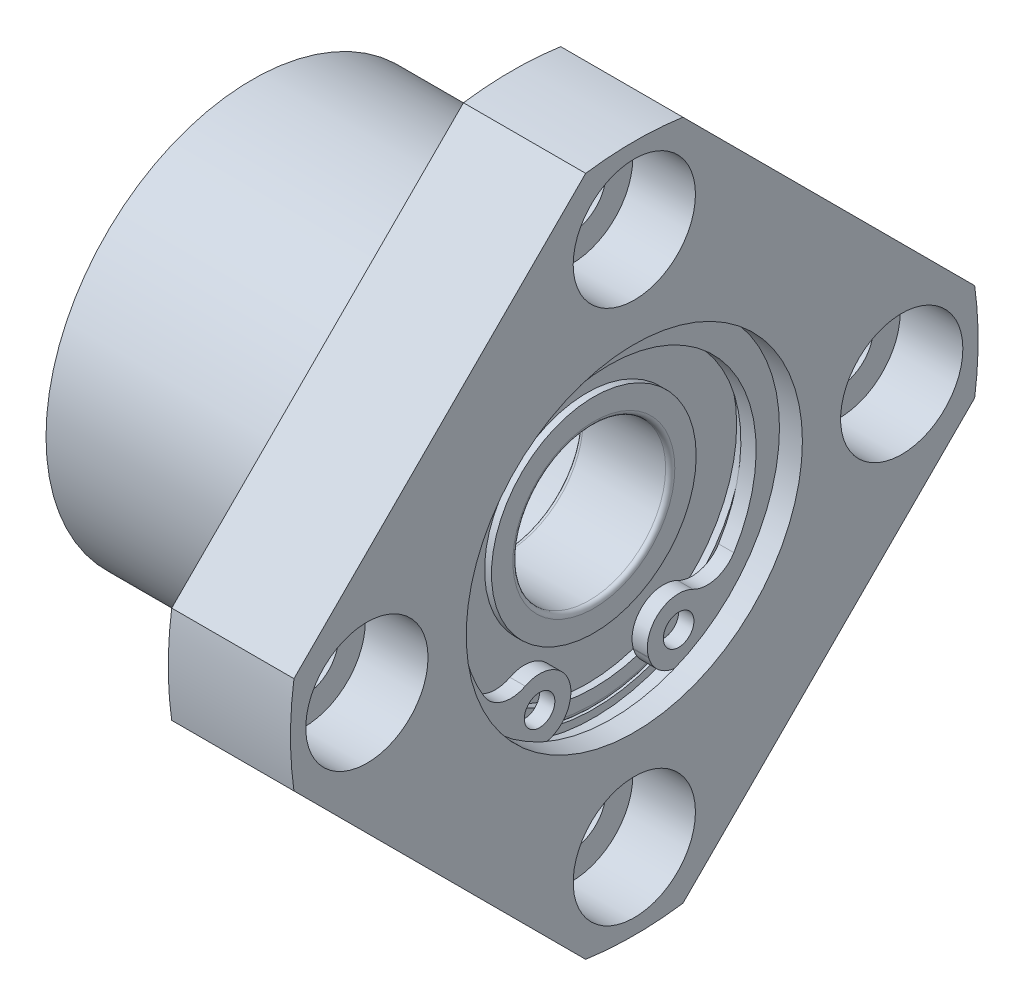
ISO-10303-21;
HEADER;
FILE_DESCRIPTION(('STEP AP214'),'2;1');
FILE_NAME('part.step','',(''),(''),'','','');
FILE_SCHEMA(('AUTOMOTIVE_DESIGN { 1 0 10303 214 1 1 1 1 }'));
ENDSEC;
DATA;
#1=APPLICATION_CONTEXT('core data for automotive mechanical design processes');
#2=APPLICATION_PROTOCOL_DEFINITION('international standard','automotive_design',2000,#1);
#3=PRODUCT_CONTEXT('',#1,'mechanical');
#4=PRODUCT('Part','Part','',(#3));
#5=PRODUCT_RELATED_PRODUCT_CATEGORY('part','',(#4));
#6=PRODUCT_DEFINITION_FORMATION('','',#4);
#7=PRODUCT_DEFINITION_CONTEXT('part definition',#1,'design');
#8=PRODUCT_DEFINITION('design','',#6,#7);
#9=PRODUCT_DEFINITION_SHAPE('','',#8);
#10=(LENGTH_UNIT() NAMED_UNIT(*) SI_UNIT(.MILLI.,.METRE.));
#11=(NAMED_UNIT(*) PLANE_ANGLE_UNIT() SI_UNIT($,.RADIAN.));
#12=(NAMED_UNIT(*) SI_UNIT($,.STERADIAN.) SOLID_ANGLE_UNIT());
#13=UNCERTAINTY_MEASURE_WITH_UNIT(LENGTH_MEASURE(1.E-05),#10,'distance_accuracy_value','');
#14=(GEOMETRIC_REPRESENTATION_CONTEXT(3) GLOBAL_UNCERTAINTY_ASSIGNED_CONTEXT((#13)) GLOBAL_UNIT_ASSIGNED_CONTEXT((#10,
#11,#12)) REPRESENTATION_CONTEXT('',''));
#15=CARTESIAN_POINT('',(0.,0.,0.));
#16=DIRECTION('',(0.,0.,1.));
#17=DIRECTION('',(1.,0.,0.));
#18=AXIS2_PLACEMENT_3D('',#15,#16,#17);
#19=CARTESIAN_POINT('',(-16.8,-9.8,0.));
#20=DIRECTION('',(1.,0.,0.));
#21=DIRECTION('',(0.,1.,0.));
#22=AXIS2_PLACEMENT_3D('',#19,#20,#21);
#23=PLANE('',#22);
#24=CARTESIAN_POINT('',(-16.8,0.,0.));
#25=DIRECTION('',(-1.,0.,0.));
#26=DIRECTION('',(0.,0.,-1.));
#27=AXIS2_PLACEMENT_3D('',#24,#25,#26);
#28=CIRCLE('',#27,6.7);
#29=CARTESIAN_POINT('',(-16.8,0.,-6.7));
#30=VERTEX_POINT('',#29);
#31=EDGE_CURVE('P0_E76',#30,#30,#28,.T.);
#32=ORIENTED_EDGE('',*,*,#31,.T.);
#33=EDGE_LOOP('',(#32));
#34=FACE_BOUND('',#33,.T.);
#35=CARTESIAN_POINT('',(-16.8,0.,0.));
#36=DIRECTION('',(-1.,0.,0.));
#37=DIRECTION('',(0.,0.,-1.));
#38=AXIS2_PLACEMENT_3D('',#35,#36,#37);
#39=CIRCLE('',#38,9.8);
#40=CARTESIAN_POINT('',(-16.8,0.,-9.8));
#41=VERTEX_POINT('',#40);
#42=EDGE_CURVE('P0_E71',#41,#41,#39,.T.);
#43=ORIENTED_EDGE('',*,*,#42,.F.);
#44=EDGE_LOOP('',(#43));
#45=FACE_BOUND('',#44,.T.);
#46=ADVANCED_FACE('P0_F15',(#34,#45),#23,.T.);
#47=CARTESIAN_POINT('',(-16.35,-10.7,0.));
#48=DIRECTION('',(1.,0.,0.));
#49=DIRECTION('',(0.,1.,0.));
#50=AXIS2_PLACEMENT_3D('',#47,#48,#49);
#51=PLANE('',#50);
#52=CARTESIAN_POINT('',(-16.35,0.,0.));
#53=DIRECTION('',(-1.,0.,0.));
#54=DIRECTION('',(0.,0.,-1.));
#55=AXIS2_PLACEMENT_3D('',#52,#53,#54);
#56=CIRCLE('',#55,9.8);
#57=CARTESIAN_POINT('',(-16.35,0.,-9.8));
#58=VERTEX_POINT('',#57);
#59=EDGE_CURVE('P0_E72',#58,#58,#56,.T.);
#60=ORIENTED_EDGE('',*,*,#59,.T.);
#61=EDGE_LOOP('',(#60));
#62=FACE_BOUND('',#61,.T.);
#63=CARTESIAN_POINT('',(-16.35,0.,0.));
#64=DIRECTION('',(-1.,0.,0.));
#65=DIRECTION('',(0.,0.,-1.));
#66=AXIS2_PLACEMENT_3D('',#63,#64,#65);
#67=CIRCLE('',#66,10.7);
#68=CARTESIAN_POINT('',(-16.35,0.,-10.7));
#69=VERTEX_POINT('',#68);
#70=EDGE_CURVE('P0_E67',#69,#69,#67,.T.);
#71=ORIENTED_EDGE('',*,*,#70,.F.);
#72=EDGE_LOOP('',(#71));
#73=FACE_BOUND('',#72,.T.);
#74=ADVANCED_FACE('P0_F116',(#62,#73),#51,.T.);
#75=CARTESIAN_POINT('',(-22.35,-9.8,0.));
#76=DIRECTION('',(-1.,0.,0.));
#77=DIRECTION('',(0.,0.,1.));
#78=AXIS2_PLACEMENT_3D('',#75,#76,#77);
#79=PLANE('',#78);
#80=CARTESIAN_POINT('',(-22.35,0.,0.));
#81=DIRECTION('',(-1.,0.,0.));
#82=DIRECTION('',(0.,0.,-1.));
#83=AXIS2_PLACEMENT_3D('',#80,#81,#82);
#84=CIRCLE('',#83,9.8);
#85=CARTESIAN_POINT('',(-22.35,0.,-9.8));
#86=VERTEX_POINT('',#85);
#87=EDGE_CURVE('P0_E50',#86,#86,#84,.T.);
#88=ORIENTED_EDGE('',*,*,#87,.F.);
#89=EDGE_LOOP('',(#88));
#90=FACE_BOUND('',#89,.T.);
#91=CARTESIAN_POINT('',(-22.35,0.,0.));
#92=DIRECTION('',(-1.,0.,0.));
#93=DIRECTION('',(0.,0.,-1.));
#94=AXIS2_PLACEMENT_3D('',#91,#92,#93);
#95=CIRCLE('',#94,10.7);
#96=CARTESIAN_POINT('',(-22.35,0.,-10.7));
#97=VERTEX_POINT('',#96);
#98=EDGE_CURVE('P0_E58',#97,#97,#95,.T.);
#99=ORIENTED_EDGE('',*,*,#98,.T.);
#100=EDGE_LOOP('',(#99));
#101=FACE_BOUND('',#100,.T.);
#102=ADVANCED_FACE('P0_F17',(#90,#101),#79,.T.);
#103=CARTESIAN_POINT('',(-21.9,-6.7,0.));
#104=DIRECTION('',(-1.,0.,0.));
#105=DIRECTION('',(0.,0.,1.));
#106=AXIS2_PLACEMENT_3D('',#103,#104,#105);
#107=PLANE('',#106);
#108=CARTESIAN_POINT('',(-21.9,0.,0.));
#109=DIRECTION('',(-1.,0.,0.));
#110=DIRECTION('',(0.,0.,-1.));
#111=AXIS2_PLACEMENT_3D('',#108,#109,#110);
#112=CIRCLE('',#111,6.7);
#113=CARTESIAN_POINT('',(-21.9,0.,-6.7));
#114=VERTEX_POINT('',#113);
#115=EDGE_CURVE('P0_E46',#114,#114,#112,.T.);
#116=ORIENTED_EDGE('',*,*,#115,.F.);
#117=EDGE_LOOP('',(#116));
#118=FACE_BOUND('',#117,.T.);
#119=CARTESIAN_POINT('',(-21.9,0.,0.));
#120=DIRECTION('',(-1.,0.,0.));
#121=DIRECTION('',(0.,0.,-1.));
#122=AXIS2_PLACEMENT_3D('',#119,#120,#121);
#123=CIRCLE('',#122,9.8);
#124=CARTESIAN_POINT('',(-21.9,0.,-9.8));
#125=VERTEX_POINT('',#124);
#126=EDGE_CURVE('P0_E54',#125,#125,#123,.T.);
#127=ORIENTED_EDGE('',*,*,#126,.T.);
#128=EDGE_LOOP('',(#127));
#129=FACE_BOUND('',#128,.T.);
#130=ADVANCED_FACE('P0_F111',(#118,#129),#107,.T.);
#131=CARTESIAN_POINT('',(-22.35,-5.3,0.));
#132=DIRECTION('',(-1.,0.,0.));
#133=DIRECTION('',(0.,0.,1.));
#134=AXIS2_PLACEMENT_3D('',#131,#132,#133);
#135=PLANE('',#134);
#136=CARTESIAN_POINT('',(-22.35,0.,0.));
#137=DIRECTION('',(-1.,0.,0.));
#138=DIRECTION('',(0.,0.,-1.));
#139=AXIS2_PLACEMENT_3D('',#136,#137,#138);
#140=CIRCLE('',#139,5.3);
#141=CARTESIAN_POINT('',(-22.35,0.,-5.3));
#142=VERTEX_POINT('',#141);
#143=EDGE_CURVE('P0_E39',#142,#142,#140,.T.);
#144=ORIENTED_EDGE('',*,*,#143,.F.);
#145=EDGE_LOOP('',(#144));
#146=FACE_BOUND('',#145,.T.);
#147=CARTESIAN_POINT('',(-22.35,0.,0.));
#148=DIRECTION('',(-1.,0.,0.));
#149=DIRECTION('',(0.,0.,-1.));
#150=AXIS2_PLACEMENT_3D('',#147,#148,#149);
#151=CIRCLE('',#150,6.7);
#152=CARTESIAN_POINT('',(-22.35,0.,-6.7));
#153=VERTEX_POINT('',#152);
#154=EDGE_CURVE('P0_E42',#153,#153,#151,.T.);
#155=ORIENTED_EDGE('',*,*,#154,.T.);
#156=EDGE_LOOP('',(#155));
#157=FACE_BOUND('',#156,.T.);
#158=ADVANCED_FACE('P0_F101',(#146,#157),#135,.T.);
#159=CARTESIAN_POINT('',(-16.35,-6.7,0.));
#160=DIRECTION('',(1.,0.,0.));
#161=DIRECTION('',(0.,1.,0.));
#162=AXIS2_PLACEMENT_3D('',#159,#160,#161);
#163=PLANE('',#162);
#164=CARTESIAN_POINT('',(-16.35,0.,0.));
#165=DIRECTION('',(-1.,0.,0.));
#166=DIRECTION('',(0.,0.,-1.));
#167=AXIS2_PLACEMENT_3D('',#164,#165,#166);
#168=CIRCLE('',#167,5.3);
#169=CARTESIAN_POINT('',(-16.35,0.,-5.3));
#170=VERTEX_POINT('',#169);
#171=EDGE_CURVE('P0_E10',#170,#170,#168,.T.);
#172=ORIENTED_EDGE('',*,*,#171,.T.);
#173=EDGE_LOOP('',(#172));
#174=FACE_BOUND('',#173,.T.);
#175=CARTESIAN_POINT('',(-16.35,0.,0.));
#176=DIRECTION('',(-1.,0.,0.));
#177=DIRECTION('',(0.,0.,-1.));
#178=AXIS2_PLACEMENT_3D('',#175,#176,#177);
#179=CIRCLE('',#178,6.7);
#180=CARTESIAN_POINT('',(-16.35,0.,-6.7));
#181=VERTEX_POINT('',#180);
#182=EDGE_CURVE('P0_E89',#181,#181,#179,.T.);
#183=ORIENTED_EDGE('',*,*,#182,.F.);
#184=EDGE_LOOP('',(#183));
#185=FACE_BOUND('',#184,.T.);
#186=ADVANCED_FACE('P0_F98',(#174,#185),#163,.T.);
#187=CARTESIAN_POINT('',(-16.65,0.,0.));
#188=DIRECTION('',(-1.,0.,0.));
#189=DIRECTION('',(0.,0.,-1.));
#190=AXIS2_PLACEMENT_3D('',#187,#188,#189);
#191=TOROIDAL_SURFACE('',#190,5.3,0.3);
#192=ORIENTED_EDGE('',*,*,#171,.F.);
#193=EDGE_LOOP('',(#192));
#194=FACE_BOUND('',#193,.T.);
#195=CARTESIAN_POINT('',(-16.65,0.,0.));
#196=DIRECTION('',(-1.,0.,0.));
#197=DIRECTION('',(0.,0.,-1.));
#198=AXIS2_PLACEMENT_3D('',#195,#196,#197);
#199=CIRCLE('',#198,5.);
#200=CARTESIAN_POINT('',(-16.65,0.,-5.));
#201=VERTEX_POINT('',#200);
#202=EDGE_CURVE('P0_E23',#201,#201,#199,.T.);
#203=ORIENTED_EDGE('',*,*,#202,.T.);
#204=EDGE_LOOP('',(#203));
#205=FACE_BOUND('',#204,.T.);
#206=ADVANCED_FACE('P0_F100',(#194,#205),#191,.T.);
#207=CARTESIAN_POINT('',(-22.35,0.,0.));
#208=DIRECTION('',(-1.,0.,0.));
#209=DIRECTION('',(0.,0.,-1.));
#210=AXIS2_PLACEMENT_3D('',#207,#208,#209);
#211=CYLINDRICAL_SURFACE('',#210,5.);
#212=CARTESIAN_POINT('',(-22.05,0.,0.));
#213=DIRECTION('',(-1.,0.,0.));
#214=DIRECTION('',(0.,0.,-1.));
#215=AXIS2_PLACEMENT_3D('',#212,#213,#214);
#216=CIRCLE('',#215,5.);
#217=CARTESIAN_POINT('',(-22.05,0.,-5.));
#218=VERTEX_POINT('',#217);
#219=EDGE_CURVE('P0_E32',#218,#218,#216,.T.);
#220=ORIENTED_EDGE('',*,*,#219,.T.);
#221=EDGE_LOOP('',(#220));
#222=FACE_BOUND('',#221,.T.);
#223=ORIENTED_EDGE('',*,*,#202,.F.);
#224=EDGE_LOOP('',(#223));
#225=FACE_BOUND('',#224,.T.);
#226=ADVANCED_FACE('P0_F108',(#222,#225),#211,.F.);
#227=CARTESIAN_POINT('',(-22.05,0.,0.));
#228=DIRECTION('',(-1.,0.,0.));
#229=DIRECTION('',(0.,0.,-1.));
#230=AXIS2_PLACEMENT_3D('',#227,#228,#229);
#231=TOROIDAL_SURFACE('',#230,5.3,0.3);
#232=ORIENTED_EDGE('',*,*,#219,.F.);
#233=EDGE_LOOP('',(#232));
#234=FACE_BOUND('',#233,.T.);
#235=ORIENTED_EDGE('',*,*,#143,.T.);
#236=EDGE_LOOP('',(#235));
#237=FACE_BOUND('',#236,.T.);
#238=ADVANCED_FACE('P0_F146',(#234,#237),#231,.T.);
#239=CARTESIAN_POINT('',(-22.35,0.,0.));
#240=DIRECTION('',(-1.,0.,0.));
#241=DIRECTION('',(0.,0.,-1.));
#242=AXIS2_PLACEMENT_3D('',#239,#240,#241);
#243=CYLINDRICAL_SURFACE('',#242,6.7);
#244=ORIENTED_EDGE('',*,*,#154,.F.);
#245=EDGE_LOOP('',(#244));
#246=FACE_BOUND('',#245,.T.);
#247=ORIENTED_EDGE('',*,*,#115,.T.);
#248=EDGE_LOOP('',(#247));
#249=FACE_BOUND('',#248,.T.);
#250=ADVANCED_FACE('P0_F143',(#246,#249),#243,.T.);
#251=CARTESIAN_POINT('',(-22.35,0.,0.));
#252=DIRECTION('',(-1.,0.,0.));
#253=DIRECTION('',(0.,0.,-1.));
#254=AXIS2_PLACEMENT_3D('',#251,#252,#253);
#255=CYLINDRICAL_SURFACE('',#254,9.8);
#256=ORIENTED_EDGE('',*,*,#87,.T.);
#257=EDGE_LOOP('',(#256));
#258=FACE_BOUND('',#257,.T.);
#259=ORIENTED_EDGE('',*,*,#126,.F.);
#260=EDGE_LOOP('',(#259));
#261=FACE_BOUND('',#260,.T.);
#262=ADVANCED_FACE('P0_F140',(#258,#261),#255,.F.);
#263=CARTESIAN_POINT('',(-22.05,0.,0.));
#264=DIRECTION('',(-1.,0.,0.));
#265=DIRECTION('',(0.,0.,-1.));
#266=AXIS2_PLACEMENT_3D('',#263,#264,#265);
#267=TOROIDAL_SURFACE('',#266,10.7,0.3);
#268=ORIENTED_EDGE('',*,*,#98,.F.);
#269=EDGE_LOOP('',(#268));
#270=FACE_BOUND('',#269,.T.);
#271=CARTESIAN_POINT('',(-22.05,0.,0.));
#272=DIRECTION('',(-1.,0.,0.));
#273=DIRECTION('',(0.,0.,-1.));
#274=AXIS2_PLACEMENT_3D('',#271,#272,#273);
#275=CIRCLE('',#274,11.);
#276=CARTESIAN_POINT('',(-22.05,0.,-11.));
#277=VERTEX_POINT('',#276);
#278=EDGE_CURVE('P0_E62',#277,#277,#275,.T.);
#279=ORIENTED_EDGE('',*,*,#278,.T.);
#280=EDGE_LOOP('',(#279));
#281=FACE_BOUND('',#280,.T.);
#282=ADVANCED_FACE('P0_F136',(#270,#281),#267,.T.);
#283=CARTESIAN_POINT('',(-22.35,0.,0.));
#284=DIRECTION('',(-1.,0.,0.));
#285=DIRECTION('',(0.,0.,-1.));
#286=AXIS2_PLACEMENT_3D('',#283,#284,#285);
#287=CYLINDRICAL_SURFACE('',#286,11.);
#288=ORIENTED_EDGE('',*,*,#278,.F.);
#289=EDGE_LOOP('',(#288));
#290=FACE_BOUND('',#289,.T.);
#291=CARTESIAN_POINT('',(-16.65,0.,0.));
#292=DIRECTION('',(-1.,0.,0.));
#293=DIRECTION('',(0.,0.,-1.));
#294=AXIS2_PLACEMENT_3D('',#291,#292,#293);
#295=CIRCLE('',#294,11.);
#296=CARTESIAN_POINT('',(-16.65,0.,-11.));
#297=VERTEX_POINT('',#296);
#298=EDGE_CURVE('P0_E66',#297,#297,#295,.T.);
#299=ORIENTED_EDGE('',*,*,#298,.T.);
#300=EDGE_LOOP('',(#299));
#301=FACE_BOUND('',#300,.T.);
#302=ADVANCED_FACE('P0_F132',(#290,#301),#287,.T.);
#303=CARTESIAN_POINT('',(-16.65,0.,0.));
#304=DIRECTION('',(-1.,0.,0.));
#305=DIRECTION('',(0.,0.,-1.));
#306=AXIS2_PLACEMENT_3D('',#303,#304,#305);
#307=TOROIDAL_SURFACE('',#306,10.7,0.3);
#308=ORIENTED_EDGE('',*,*,#298,.F.);
#309=EDGE_LOOP('',(#308));
#310=FACE_BOUND('',#309,.T.);
#311=ORIENTED_EDGE('',*,*,#70,.T.);
#312=EDGE_LOOP('',(#311));
#313=FACE_BOUND('',#312,.T.);
#314=ADVANCED_FACE('P0_F129',(#310,#313),#307,.T.);
#315=CARTESIAN_POINT('',(-22.35,0.,0.));
#316=DIRECTION('',(-1.,0.,0.));
#317=DIRECTION('',(0.,0.,-1.));
#318=AXIS2_PLACEMENT_3D('',#315,#316,#317);
#319=CYLINDRICAL_SURFACE('',#318,9.8);
#320=ORIENTED_EDGE('',*,*,#42,.T.);
#321=EDGE_LOOP('',(#320));
#322=FACE_BOUND('',#321,.T.);
#323=ORIENTED_EDGE('',*,*,#59,.F.);
#324=EDGE_LOOP('',(#323));
#325=FACE_BOUND('',#324,.T.);
#326=ADVANCED_FACE('P0_F127',(#322,#325),#319,.F.);
#327=CARTESIAN_POINT('',(-22.35,0.,0.));
#328=DIRECTION('',(-1.,0.,0.));
#329=DIRECTION('',(0.,0.,-1.));
#330=AXIS2_PLACEMENT_3D('',#327,#328,#329);
#331=CYLINDRICAL_SURFACE('',#330,6.7);
#332=ORIENTED_EDGE('',*,*,#31,.F.);
#333=EDGE_LOOP('',(#332));
#334=FACE_BOUND('',#333,.T.);
#335=ORIENTED_EDGE('',*,*,#182,.T.);
#336=EDGE_LOOP('',(#335));
#337=FACE_BOUND('',#336,.T.);
#338=ADVANCED_FACE('P0_F96',(#334,#337),#331,.T.);
#339=CLOSED_SHELL('',(#46,#74,#102,#130,#158,#186,#206,#226,#238,#250,#262,#282,#302,#314,#326,#338));
#340=MANIFOLD_SOLID_BREP('P0_B1',#339);
#341=CARTESIAN_POINT('',(-8.2,9.8,0.));
#342=DIRECTION('',(-1.,0.,0.));
#343=DIRECTION('',(0.,0.,1.));
#344=AXIS2_PLACEMENT_3D('',#341,#342,#343);
#345=PLANE('',#344);
#346=CARTESIAN_POINT('',(-8.2,0.,0.));
#347=DIRECTION('',(1.,0.,0.));
#348=DIRECTION('',(0.,0.,-1.));
#349=AXIS2_PLACEMENT_3D('',#346,#347,#348);
#350=CIRCLE('',#349,6.7);
#351=CARTESIAN_POINT('',(-8.2,0.,-6.7));
#352=VERTEX_POINT('',#351);
#353=EDGE_CURVE('P1_E72',#352,#352,#350,.T.);
#354=ORIENTED_EDGE('',*,*,#353,.T.);
#355=EDGE_LOOP('',(#354));
#356=FACE_BOUND('',#355,.T.);
#357=CARTESIAN_POINT('',(-8.2,0.,0.));
#358=DIRECTION('',(1.,0.,0.));
#359=DIRECTION('',(0.,0.,-1.));
#360=AXIS2_PLACEMENT_3D('',#357,#358,#359);
#361=CIRCLE('',#360,9.8);
#362=CARTESIAN_POINT('',(-8.2,0.,-9.8));
#363=VERTEX_POINT('',#362);
#364=EDGE_CURVE('P1_E64',#363,#363,#361,.T.);
#365=ORIENTED_EDGE('',*,*,#364,.F.);
#366=EDGE_LOOP('',(#365));
#367=FACE_BOUND('',#366,.T.);
#368=ADVANCED_FACE('P1_F15',(#356,#367),#345,.T.);
#369=CARTESIAN_POINT('',(-8.65,10.7,0.));
#370=DIRECTION('',(-1.,0.,0.));
#371=DIRECTION('',(0.,0.,1.));
#372=AXIS2_PLACEMENT_3D('',#369,#370,#371);
#373=PLANE('',#372);
#374=CARTESIAN_POINT('',(-8.65,0.,0.));
#375=DIRECTION('',(1.,0.,0.));
#376=DIRECTION('',(0.,0.,-1.));
#377=AXIS2_PLACEMENT_3D('',#374,#375,#376);
#378=CIRCLE('',#377,9.8);
#379=CARTESIAN_POINT('',(-8.65,0.,-9.8));
#380=VERTEX_POINT('',#379);
#381=EDGE_CURVE('P1_E68',#380,#380,#378,.T.);
#382=ORIENTED_EDGE('',*,*,#381,.T.);
#383=EDGE_LOOP('',(#382));
#384=FACE_BOUND('',#383,.T.);
#385=CARTESIAN_POINT('',(-8.65,0.,0.));
#386=DIRECTION('',(1.,0.,0.));
#387=DIRECTION('',(0.,0.,-1.));
#388=AXIS2_PLACEMENT_3D('',#385,#386,#387);
#389=CIRCLE('',#388,10.7);
#390=CARTESIAN_POINT('',(-8.65,0.,-10.7));
#391=VERTEX_POINT('',#390);
#392=EDGE_CURVE('P1_E59',#391,#391,#389,.T.);
#393=ORIENTED_EDGE('',*,*,#392,.F.);
#394=EDGE_LOOP('',(#393));
#395=FACE_BOUND('',#394,.T.);
#396=ADVANCED_FACE('P1_F102',(#384,#395),#373,.T.);
#397=CARTESIAN_POINT('',(-2.65,9.8,0.));
#398=DIRECTION('',(1.,0.,0.));
#399=DIRECTION('',(0.,1.,0.));
#400=AXIS2_PLACEMENT_3D('',#397,#398,#399);
#401=PLANE('',#400);
#402=CARTESIAN_POINT('',(-2.65,0.,0.));
#403=DIRECTION('',(1.,0.,0.));
#404=DIRECTION('',(0.,0.,-1.));
#405=AXIS2_PLACEMENT_3D('',#402,#403,#404);
#406=CIRCLE('',#405,9.8);
#407=CARTESIAN_POINT('',(-2.65,0.,-9.8));
#408=VERTEX_POINT('',#407);
#409=EDGE_CURVE('P1_E46',#408,#408,#406,.T.);
#410=ORIENTED_EDGE('',*,*,#409,.F.);
#411=EDGE_LOOP('',(#410));
#412=FACE_BOUND('',#411,.T.);
#413=CARTESIAN_POINT('',(-2.65,0.,0.));
#414=DIRECTION('',(1.,0.,0.));
#415=DIRECTION('',(0.,0.,-1.));
#416=AXIS2_PLACEMENT_3D('',#413,#414,#415);
#417=CIRCLE('',#416,10.7);
#418=CARTESIAN_POINT('',(-2.65,0.,-10.7));
#419=VERTEX_POINT('',#418);
#420=EDGE_CURVE('P1_E51',#419,#419,#417,.T.);
#421=ORIENTED_EDGE('',*,*,#420,.T.);
#422=EDGE_LOOP('',(#421));
#423=FACE_BOUND('',#422,.T.);
#424=ADVANCED_FACE('P1_F98',(#412,#423),#401,.T.);
#425=CARTESIAN_POINT('',(-3.1,6.7,0.));
#426=DIRECTION('',(1.,0.,0.));
#427=DIRECTION('',(0.,1.,0.));
#428=AXIS2_PLACEMENT_3D('',#425,#426,#427);
#429=PLANE('',#428);
#430=CARTESIAN_POINT('',(-3.1,0.,0.));
#431=DIRECTION('',(1.,0.,0.));
#432=DIRECTION('',(0.,0.,-1.));
#433=AXIS2_PLACEMENT_3D('',#430,#431,#432);
#434=CIRCLE('',#433,6.7);
#435=CARTESIAN_POINT('',(-3.1,0.,-6.7));
#436=VERTEX_POINT('',#435);
#437=EDGE_CURVE('P1_E41',#436,#436,#434,.T.);
#438=ORIENTED_EDGE('',*,*,#437,.F.);
#439=EDGE_LOOP('',(#438));
#440=FACE_BOUND('',#439,.T.);
#441=CARTESIAN_POINT('',(-3.1,0.,0.));
#442=DIRECTION('',(1.,0.,0.));
#443=DIRECTION('',(0.,0.,-1.));
#444=AXIS2_PLACEMENT_3D('',#441,#442,#443);
#445=CIRCLE('',#444,9.8);
#446=CARTESIAN_POINT('',(-3.1,0.,-9.8));
#447=VERTEX_POINT('',#446);
#448=EDGE_CURVE('P1_E47',#447,#447,#445,.T.);
#449=ORIENTED_EDGE('',*,*,#448,.T.);
#450=EDGE_LOOP('',(#449));
#451=FACE_BOUND('',#450,.T.);
#452=ADVANCED_FACE('P1_F101',(#440,#451),#429,.T.);
#453=CARTESIAN_POINT('',(-2.65,5.3,0.));
#454=DIRECTION('',(1.,0.,0.));
#455=DIRECTION('',(0.,1.,0.));
#456=AXIS2_PLACEMENT_3D('',#453,#454,#455);
#457=PLANE('',#456);
#458=CARTESIAN_POINT('',(-2.65,0.,0.));
#459=DIRECTION('',(1.,0.,0.));
#460=DIRECTION('',(0.,0.,-1.));
#461=AXIS2_PLACEMENT_3D('',#458,#459,#460);
#462=CIRCLE('',#461,5.3);
#463=CARTESIAN_POINT('',(-2.65,0.,-5.3));
#464=VERTEX_POINT('',#463);
#465=EDGE_CURVE('P1_E38',#464,#464,#462,.T.);
#466=ORIENTED_EDGE('',*,*,#465,.F.);
#467=EDGE_LOOP('',(#466));
#468=FACE_BOUND('',#467,.T.);
#469=CARTESIAN_POINT('',(-2.65,0.,0.));
#470=DIRECTION('',(1.,0.,0.));
#471=DIRECTION('',(0.,0.,-1.));
#472=AXIS2_PLACEMENT_3D('',#469,#470,#471);
#473=CIRCLE('',#472,6.7);
#474=CARTESIAN_POINT('',(-2.65,0.,-6.7));
#475=VERTEX_POINT('',#474);
#476=EDGE_CURVE('P1_E45',#475,#475,#473,.T.);
#477=ORIENTED_EDGE('',*,*,#476,.T.);
#478=EDGE_LOOP('',(#477));
#479=FACE_BOUND('',#478,.T.);
#480=ADVANCED_FACE('P1_F135',(#468,#479),#457,.T.);
#481=CARTESIAN_POINT('',(-8.65,6.7,0.));
#482=DIRECTION('',(-1.,0.,0.));
#483=DIRECTION('',(0.,0.,1.));
#484=AXIS2_PLACEMENT_3D('',#481,#482,#483);
#485=PLANE('',#484);
#486=CARTESIAN_POINT('',(-8.65,0.,0.));
#487=DIRECTION('',(1.,0.,0.));
#488=DIRECTION('',(0.,0.,-1.));
#489=AXIS2_PLACEMENT_3D('',#486,#487,#488);
#490=CIRCLE('',#489,5.3);
#491=CARTESIAN_POINT('',(-8.65,0.,-5.3));
#492=VERTEX_POINT('',#491);
#493=EDGE_CURVE('P1_E10',#492,#492,#490,.T.);
#494=ORIENTED_EDGE('',*,*,#493,.T.);
#495=EDGE_LOOP('',(#494));
#496=FACE_BOUND('',#495,.T.);
#497=CARTESIAN_POINT('',(-8.65,0.,0.));
#498=DIRECTION('',(1.,0.,0.));
#499=DIRECTION('',(0.,0.,-1.));
#500=AXIS2_PLACEMENT_3D('',#497,#498,#499);
#501=CIRCLE('',#500,6.7);
#502=CARTESIAN_POINT('',(-8.65,0.,-6.7));
#503=VERTEX_POINT('',#502);
#504=EDGE_CURVE('P1_E79',#503,#503,#501,.T.);
#505=ORIENTED_EDGE('',*,*,#504,.F.);
#506=EDGE_LOOP('',(#505));
#507=FACE_BOUND('',#506,.T.);
#508=ADVANCED_FACE('P1_F137',(#496,#507),#485,.T.);
#509=CARTESIAN_POINT('',(-8.35,0.,0.));
#510=DIRECTION('',(1.,0.,0.));
#511=DIRECTION('',(0.,0.,-1.));
#512=AXIS2_PLACEMENT_3D('',#509,#510,#511);
#513=TOROIDAL_SURFACE('',#512,5.3,0.3);
#514=ORIENTED_EDGE('',*,*,#493,.F.);
#515=EDGE_LOOP('',(#514));
#516=FACE_BOUND('',#515,.T.);
#517=CARTESIAN_POINT('',(-8.35,0.,0.));
#518=DIRECTION('',(1.,0.,0.));
#519=DIRECTION('',(0.,0.,-1.));
#520=AXIS2_PLACEMENT_3D('',#517,#518,#519);
#521=CIRCLE('',#520,5.);
#522=CARTESIAN_POINT('',(-8.35,0.,-5.));
#523=VERTEX_POINT('',#522);
#524=EDGE_CURVE('P1_E22',#523,#523,#521,.T.);
#525=ORIENTED_EDGE('',*,*,#524,.T.);
#526=EDGE_LOOP('',(#525));
#527=FACE_BOUND('',#526,.T.);
#528=ADVANCED_FACE('P1_F140',(#516,#527),#513,.T.);
#529=CARTESIAN_POINT('',(-2.65,0.,0.));
#530=DIRECTION('',(1.,0.,0.));
#531=DIRECTION('',(0.,0.,-1.));
#532=AXIS2_PLACEMENT_3D('',#529,#530,#531);
#533=CYLINDRICAL_SURFACE('',#532,5.);
#534=CARTESIAN_POINT('',(-2.95,0.,0.));
#535=DIRECTION('',(1.,0.,0.));
#536=DIRECTION('',(0.,0.,-1.));
#537=AXIS2_PLACEMENT_3D('',#534,#535,#536);
#538=CIRCLE('',#537,5.);
#539=CARTESIAN_POINT('',(-2.95,0.,-5.));
#540=VERTEX_POINT('',#539);
#541=EDGE_CURVE('P1_E31',#540,#540,#538,.T.);
#542=ORIENTED_EDGE('',*,*,#541,.T.);
#543=EDGE_LOOP('',(#542));
#544=FACE_BOUND('',#543,.T.);
#545=ORIENTED_EDGE('',*,*,#524,.F.);
#546=EDGE_LOOP('',(#545));
#547=FACE_BOUND('',#546,.T.);
#548=ADVANCED_FACE('P1_F141',(#544,#547),#533,.F.);
#549=CARTESIAN_POINT('',(-2.95,0.,0.));
#550=DIRECTION('',(1.,0.,0.));
#551=DIRECTION('',(0.,0.,-1.));
#552=AXIS2_PLACEMENT_3D('',#549,#550,#551);
#553=TOROIDAL_SURFACE('',#552,5.3,0.3);
#554=ORIENTED_EDGE('',*,*,#541,.F.);
#555=EDGE_LOOP('',(#554));
#556=FACE_BOUND('',#555,.T.);
#557=ORIENTED_EDGE('',*,*,#465,.T.);
#558=EDGE_LOOP('',(#557));
#559=FACE_BOUND('',#558,.T.);
#560=ADVANCED_FACE('P1_F144',(#556,#559),#553,.T.);
#561=CARTESIAN_POINT('',(-2.65,0.,0.));
#562=DIRECTION('',(1.,0.,0.));
#563=DIRECTION('',(0.,0.,-1.));
#564=AXIS2_PLACEMENT_3D('',#561,#562,#563);
#565=CYLINDRICAL_SURFACE('',#564,6.7);
#566=ORIENTED_EDGE('',*,*,#476,.F.);
#567=EDGE_LOOP('',(#566));
#568=FACE_BOUND('',#567,.T.);
#569=ORIENTED_EDGE('',*,*,#437,.T.);
#570=EDGE_LOOP('',(#569));
#571=FACE_BOUND('',#570,.T.);
#572=ADVANCED_FACE('P1_F151',(#568,#571),#565,.T.);
#573=CARTESIAN_POINT('',(-2.65,0.,0.));
#574=DIRECTION('',(1.,0.,0.));
#575=DIRECTION('',(0.,0.,-1.));
#576=AXIS2_PLACEMENT_3D('',#573,#574,#575);
#577=CYLINDRICAL_SURFACE('',#576,9.8);
#578=ORIENTED_EDGE('',*,*,#409,.T.);
#579=EDGE_LOOP('',(#578));
#580=FACE_BOUND('',#579,.T.);
#581=ORIENTED_EDGE('',*,*,#448,.F.);
#582=EDGE_LOOP('',(#581));
#583=FACE_BOUND('',#582,.T.);
#584=ADVANCED_FACE('P1_F95',(#580,#583),#577,.F.);
#585=CARTESIAN_POINT('',(-2.95,0.,0.));
#586=DIRECTION('',(1.,0.,0.));
#587=DIRECTION('',(0.,0.,-1.));
#588=AXIS2_PLACEMENT_3D('',#585,#586,#587);
#589=TOROIDAL_SURFACE('',#588,10.7,0.3);
#590=ORIENTED_EDGE('',*,*,#420,.F.);
#591=EDGE_LOOP('',(#590));
#592=FACE_BOUND('',#591,.T.);
#593=CARTESIAN_POINT('',(-2.95,0.,0.));
#594=DIRECTION('',(1.,0.,0.));
#595=DIRECTION('',(0.,0.,-1.));
#596=AXIS2_PLACEMENT_3D('',#593,#594,#595);
#597=CIRCLE('',#596,11.);
#598=CARTESIAN_POINT('',(-2.95,0.,-11.));
#599=VERTEX_POINT('',#598);
#600=EDGE_CURVE('P1_E55',#599,#599,#597,.T.);
#601=ORIENTED_EDGE('',*,*,#600,.T.);
#602=EDGE_LOOP('',(#601));
#603=FACE_BOUND('',#602,.T.);
#604=ADVANCED_FACE('P1_F106',(#592,#603),#589,.T.);
#605=CARTESIAN_POINT('',(-2.65,0.,0.));
#606=DIRECTION('',(1.,0.,0.));
#607=DIRECTION('',(0.,0.,-1.));
#608=AXIS2_PLACEMENT_3D('',#605,#606,#607);
#609=CYLINDRICAL_SURFACE('',#608,11.);
#610=ORIENTED_EDGE('',*,*,#600,.F.);
#611=EDGE_LOOP('',(#610));
#612=FACE_BOUND('',#611,.T.);
#613=CARTESIAN_POINT('',(-8.35,0.,0.));
#614=DIRECTION('',(1.,0.,0.));
#615=DIRECTION('',(0.,0.,-1.));
#616=AXIS2_PLACEMENT_3D('',#613,#614,#615);
#617=CIRCLE('',#616,11.);
#618=CARTESIAN_POINT('',(-8.35,0.,-11.));
#619=VERTEX_POINT('',#618);
#620=EDGE_CURVE('P1_E63',#619,#619,#617,.T.);
#621=ORIENTED_EDGE('',*,*,#620,.T.);
#622=EDGE_LOOP('',(#621));
#623=FACE_BOUND('',#622,.T.);
#624=ADVANCED_FACE('P1_F109',(#612,#623),#609,.T.);
#625=CARTESIAN_POINT('',(-8.35,0.,0.));
#626=DIRECTION('',(1.,0.,0.));
#627=DIRECTION('',(0.,0.,-1.));
#628=AXIS2_PLACEMENT_3D('',#625,#626,#627);
#629=TOROIDAL_SURFACE('',#628,10.7,0.3);
#630=ORIENTED_EDGE('',*,*,#620,.F.);
#631=EDGE_LOOP('',(#630));
#632=FACE_BOUND('',#631,.T.);
#633=ORIENTED_EDGE('',*,*,#392,.T.);
#634=EDGE_LOOP('',(#633));
#635=FACE_BOUND('',#634,.T.);
#636=ADVANCED_FACE('P1_F115',(#632,#635),#629,.T.);
#637=CARTESIAN_POINT('',(-2.65,0.,0.));
#638=DIRECTION('',(1.,0.,0.));
#639=DIRECTION('',(0.,0.,-1.));
#640=AXIS2_PLACEMENT_3D('',#637,#638,#639);
#641=CYLINDRICAL_SURFACE('',#640,9.8);
#642=ORIENTED_EDGE('',*,*,#364,.T.);
#643=EDGE_LOOP('',(#642));
#644=FACE_BOUND('',#643,.T.);
#645=ORIENTED_EDGE('',*,*,#381,.F.);
#646=EDGE_LOOP('',(#645));
#647=FACE_BOUND('',#646,.T.);
#648=ADVANCED_FACE('P1_F121',(#644,#647),#641,.F.);
#649=CARTESIAN_POINT('',(-2.65,0.,0.));
#650=DIRECTION('',(1.,0.,0.));
#651=DIRECTION('',(0.,0.,-1.));
#652=AXIS2_PLACEMENT_3D('',#649,#650,#651);
#653=CYLINDRICAL_SURFACE('',#652,6.7);
#654=ORIENTED_EDGE('',*,*,#353,.F.);
#655=EDGE_LOOP('',(#654));
#656=FACE_BOUND('',#655,.T.);
#657=ORIENTED_EDGE('',*,*,#504,.T.);
#658=EDGE_LOOP('',(#657));
#659=FACE_BOUND('',#658,.T.);
#660=ADVANCED_FACE('P1_F157',(#656,#659),#653,.T.);
#661=CLOSED_SHELL('',(#368,#396,#424,#452,#480,#508,#528,#548,#560,#572,#584,#604,#624,#636,
#648,#660));
#662=MANIFOLD_SOLID_BREP('P1_B1',#661);
#663=CARTESIAN_POINT('',(-22.35,-8.35614485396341,4.51938526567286));
#664=DIRECTION('',(-1.,0.,0.));
#665=DIRECTION('',(0.,0.,1.));
#666=AXIS2_PLACEMENT_3D('',#663,#664,#665);
#667=PLANE('',#666);
#668=CARTESIAN_POINT('',(-22.35,-8.28251169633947,4.55));
#669=DIRECTION('',(-1.,0.,0.));
#670=DIRECTION('',(0.,0.,1.));
#671=AXIS2_PLACEMENT_3D('',#668,#669,#670);
#672=CIRCLE('',#671,1.);
#673=CARTESIAN_POINT('',(-22.35,-8.28251169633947,5.55));
#674=VERTEX_POINT('',#673);
#675=EDGE_CURVE('P2_E139',#674,#674,#672,.T.);
#676=ORIENTED_EDGE('',*,*,#675,.T.);
#677=EDGE_LOOP('',(#676));
#678=FACE_BOUND('',#677,.T.);
#679=CARTESIAN_POINT('',(-22.35,-8.28251169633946,-4.55));
#680=DIRECTION('',(-1.,0.,0.));
#681=DIRECTION('',(0.,0.,1.));
#682=AXIS2_PLACEMENT_3D('',#679,#680,#681);
#683=CIRCLE('',#682,1.);
#684=CARTESIAN_POINT('',(-22.35,-8.28251169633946,-3.55));
#685=VERTEX_POINT('',#684);
#686=EDGE_CURVE('P2_E252',#685,#685,#683,.T.);
#687=ORIENTED_EDGE('',*,*,#686,.T.);
#688=EDGE_LOOP('',(#687));
#689=FACE_BOUND('',#688,.T.);
#690=CARTESIAN_POINT('',(-22.35,-8.35614485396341,4.51938526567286));
#691=DIRECTION('',(-1.,0.,0.));
#692=DIRECTION('',(0.,0.,1.));
#693=AXIS2_PLACEMENT_3D('',#690,#691,#692);
#694=CIRCLE('',#693,2.);
#695=CARTESIAN_POINT('',(-22.35,-8.9159152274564,2.59931830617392));
#696=VERTEX_POINT('',#695);
#697=CARTESIAN_POINT('',(-22.35,-10.1153332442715,5.4708347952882));
#698=VERTEX_POINT('',#697);
#699=EDGE_CURVE('P2_E172',#696,#698,#694,.T.);
#700=ORIENTED_EDGE('',*,*,#699,.F.);
#701=DIRECTION('',(0.,-0.960033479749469,0.279885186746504));
#702=VECTOR('',#701,1.);
#703=CARTESIAN_POINT('',(-22.35,-8.85627632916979,2.58193136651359));
#704=LINE('',#703,#702);
#705=CARTESIAN_POINT('',(-22.35,-8.85627632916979,2.58193136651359));
#706=VERTEX_POINT('',#705);
#707=EDGE_CURVE('P2_E25',#706,#696,#704,.T.);
#708=ORIENTED_EDGE('',*,*,#707,.F.);
#709=CARTESIAN_POINT('',(-22.35,-8.28251169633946,4.55));
#710=DIRECTION('',(-1.,0.,0.));
#711=DIRECTION('',(0.,0.,1.));
#712=AXIS2_PLACEMENT_3D('',#709,#710,#711);
#713=CIRCLE('',#712,2.05);
#714=CARTESIAN_POINT('',(-22.35,-6.45957449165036,5.48776326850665));
#715=VERTEX_POINT('',#714);
#716=EDGE_CURVE('P2_E49',#715,#706,#713,.T.);
#717=ORIENTED_EDGE('',*,*,#716,.F.);
#718=CARTESIAN_POINT('',(-22.35,-4.63663728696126,6.4255265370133));
#719=DIRECTION('',(-1.,0.,0.));
#720=DIRECTION('',(0.,0.,1.));
#721=AXIS2_PLACEMENT_3D('',#718,#719,#720);
#722=CIRCLE('',#721,2.05);
#723=CARTESIAN_POINT('',(-22.35,-5.72229490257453,8.16444791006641));
#724=VERTEX_POINT('',#723);
#725=EDGE_CURVE('P2_E189',#715,#724,#722,.T.);
#726=ORIENTED_EDGE('',*,*,#725,.T.);
#727=CARTESIAN_POINT('',(-22.35,-0.625,0.));
#728=DIRECTION('',(-1.,0.,0.));
#729=DIRECTION('',(0.,0.,1.));
#730=AXIS2_PLACEMENT_3D('',#727,#728,#729);
#731=CIRCLE('',#730,9.625);
#732=CARTESIAN_POINT('',(-22.35,-5.72229490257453,-8.16444791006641));
#733=VERTEX_POINT('',#732);
#734=EDGE_CURVE('P2_E163',#724,#733,#731,.T.);
#735=ORIENTED_EDGE('',*,*,#734,.T.);
#736=CARTESIAN_POINT('',(-22.35,-4.63663728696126,-6.4255265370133));
#737=DIRECTION('',(-1.,0.,0.));
#738=DIRECTION('',(0.,0.,1.));
#739=AXIS2_PLACEMENT_3D('',#736,#737,#738);
#740=CIRCLE('',#739,2.05);
#741=CARTESIAN_POINT('',(-22.35,-6.45957449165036,-5.48776326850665));
#742=VERTEX_POINT('',#741);
#743=EDGE_CURVE('P2_E168',#733,#742,#740,.T.);
#744=ORIENTED_EDGE('',*,*,#743,.T.);
#745=CARTESIAN_POINT('',(-22.35,-8.28251169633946,-4.55));
#746=DIRECTION('',(-1.,0.,0.));
#747=DIRECTION('',(0.,0.,1.));
#748=AXIS2_PLACEMENT_3D('',#745,#746,#747);
#749=CIRCLE('',#748,2.05);
#750=CARTESIAN_POINT('',(-22.35,-8.85627632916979,-2.58193136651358));
#751=VERTEX_POINT('',#750);
#752=EDGE_CURVE('P2_E151',#751,#742,#749,.T.);
#753=ORIENTED_EDGE('',*,*,#752,.F.);
#754=DIRECTION('',(0.,0.96003347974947,0.279885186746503));
#755=VECTOR('',#754,1.);
#756=CARTESIAN_POINT('',(-22.35,-8.9159152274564,-2.59931830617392));
#757=LINE('',#756,#755);
#758=CARTESIAN_POINT('',(-22.35,-8.9159152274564,-2.59931830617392));
#759=VERTEX_POINT('',#758);
#760=EDGE_CURVE('P2_E157',#759,#751,#757,.T.);
#761=ORIENTED_EDGE('',*,*,#760,.F.);
#762=CARTESIAN_POINT('',(-22.35,-8.3561448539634,-4.51938526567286));
#763=DIRECTION('',(-1.,0.,0.));
#764=DIRECTION('',(0.,0.,1.));
#765=AXIS2_PLACEMENT_3D('',#762,#763,#764);
#766=CIRCLE('',#765,2.);
#767=CARTESIAN_POINT('',(-22.35,-10.1153332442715,-5.47083479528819));
#768=VERTEX_POINT('',#767);
#769=EDGE_CURVE('P2_E198',#768,#759,#766,.T.);
#770=ORIENTED_EDGE('',*,*,#769,.F.);
#771=CARTESIAN_POINT('',(-22.35,0.,0.));
#772=DIRECTION('',(-1.,0.,0.));
#773=DIRECTION('',(0.,0.,1.));
#774=AXIS2_PLACEMENT_3D('',#771,#772,#773);
#775=CIRCLE('',#774,11.5);
#776=EDGE_CURVE('P2_E180',#698,#768,#775,.T.);
#777=ORIENTED_EDGE('',*,*,#776,.F.);
#778=EDGE_LOOP('',(#700,#708,#717,#726,#735,#744,#753,#761,#770,#777));
#779=FACE_BOUND('',#778,.T.);
#780=ADVANCED_FACE('P2_F17',(#678,#689,#779),#667,.F.);
#781=CARTESIAN_POINT('',(-23.35,-8.35614485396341,4.51938526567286));
#782=DIRECTION('',(-1.,0.,0.));
#783=DIRECTION('',(0.,0.,1.));
#784=AXIS2_PLACEMENT_3D('',#781,#782,#783);
#785=PLANE('',#784);
#786=CARTESIAN_POINT('',(-23.35,-8.28251169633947,4.55));
#787=DIRECTION('',(-1.,0.,0.));
#788=DIRECTION('',(0.,0.,1.));
#789=AXIS2_PLACEMENT_3D('',#786,#787,#788);
#790=CIRCLE('',#789,1.);
#791=CARTESIAN_POINT('',(-23.35,-8.28251169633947,5.55));
#792=VERTEX_POINT('',#791);
#793=EDGE_CURVE('P2_E147',#792,#792,#790,.T.);
#794=ORIENTED_EDGE('',*,*,#793,.F.);
#795=EDGE_LOOP('',(#794));
#796=FACE_BOUND('',#795,.T.);
#797=CARTESIAN_POINT('',(-23.35,-8.28251169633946,-4.55));
#798=DIRECTION('',(-1.,0.,0.));
#799=DIRECTION('',(0.,0.,1.));
#800=AXIS2_PLACEMENT_3D('',#797,#798,#799);
#801=CIRCLE('',#800,1.);
#802=CARTESIAN_POINT('',(-23.35,-8.28251169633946,-3.55));
#803=VERTEX_POINT('',#802);
#804=EDGE_CURVE('P2_E248',#803,#803,#801,.T.);
#805=ORIENTED_EDGE('',*,*,#804,.F.);
#806=EDGE_LOOP('',(#805));
#807=FACE_BOUND('',#806,.T.);
#808=CARTESIAN_POINT('',(-23.35,-8.35614485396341,4.51938526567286));
#809=DIRECTION('',(-1.,0.,0.));
#810=DIRECTION('',(0.,0.,1.));
#811=AXIS2_PLACEMENT_3D('',#808,#809,#810);
#812=CIRCLE('',#811,2.);
#813=CARTESIAN_POINT('',(-23.35,-8.9159152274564,2.59931830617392));
#814=VERTEX_POINT('',#813);
#815=CARTESIAN_POINT('',(-23.35,-10.1153332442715,5.4708347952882));
#816=VERTEX_POINT('',#815);
#817=EDGE_CURVE('P2_E193',#814,#816,#812,.T.);
#818=ORIENTED_EDGE('',*,*,#817,.T.);
#819=CARTESIAN_POINT('',(-23.35,0.,0.));
#820=DIRECTION('',(-1.,0.,0.));
#821=DIRECTION('',(0.,0.,1.));
#822=AXIS2_PLACEMENT_3D('',#819,#820,#821);
#823=CIRCLE('',#822,11.5);
#824=CARTESIAN_POINT('',(-23.35,-10.1153332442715,-5.47083479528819));
#825=VERTEX_POINT('',#824);
#826=EDGE_CURVE('P2_E162',#816,#825,#823,.T.);
#827=ORIENTED_EDGE('',*,*,#826,.T.);
#828=CARTESIAN_POINT('',(-23.35,-8.3561448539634,-4.51938526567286));
#829=DIRECTION('',(-1.,0.,0.));
#830=DIRECTION('',(0.,0.,1.));
#831=AXIS2_PLACEMENT_3D('',#828,#829,#830);
#832=CIRCLE('',#831,2.);
#833=CARTESIAN_POINT('',(-23.35,-8.9159152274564,-2.59931830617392));
#834=VERTEX_POINT('',#833);
#835=EDGE_CURVE('P2_E206',#825,#834,#832,.T.);
#836=ORIENTED_EDGE('',*,*,#835,.T.);
#837=DIRECTION('',(0.,0.96003347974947,0.279885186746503));
#838=VECTOR('',#837,1.);
#839=CARTESIAN_POINT('',(-23.35,-8.9159152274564,-2.59931830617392));
#840=LINE('',#839,#838);
#841=CARTESIAN_POINT('',(-23.35,-8.85627632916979,-2.58193136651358));
#842=VERTEX_POINT('',#841);
#843=EDGE_CURVE('P2_E156',#834,#842,#840,.T.);
#844=ORIENTED_EDGE('',*,*,#843,.T.);
#845=CARTESIAN_POINT('',(-23.35,-8.28251169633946,-4.55));
#846=DIRECTION('',(-1.,0.,0.));
#847=DIRECTION('',(0.,0.,1.));
#848=AXIS2_PLACEMENT_3D('',#845,#846,#847);
#849=CIRCLE('',#848,2.05);
#850=CARTESIAN_POINT('',(-23.35,-6.45957449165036,-5.48776326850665));
#851=VERTEX_POINT('',#850);
#852=EDGE_CURVE('P2_E217',#842,#851,#849,.T.);
#853=ORIENTED_EDGE('',*,*,#852,.T.);
#854=CARTESIAN_POINT('',(-23.35,-4.63663728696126,-6.4255265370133));
#855=DIRECTION('',(-1.,0.,0.));
#856=DIRECTION('',(0.,0.,1.));
#857=AXIS2_PLACEMENT_3D('',#854,#855,#856);
#858=CIRCLE('',#857,2.05);
#859=CARTESIAN_POINT('',(-23.35,-5.72229490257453,-8.16444791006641));
#860=VERTEX_POINT('',#859);
#861=EDGE_CURVE('P2_E167',#860,#851,#858,.T.);
#862=ORIENTED_EDGE('',*,*,#861,.F.);
#863=CARTESIAN_POINT('',(-23.35,-0.625,0.));
#864=DIRECTION('',(-1.,0.,0.));
#865=DIRECTION('',(0.,0.,1.));
#866=AXIS2_PLACEMENT_3D('',#863,#864,#865);
#867=CIRCLE('',#866,9.625);
#868=CARTESIAN_POINT('',(-23.35,-5.72229490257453,8.16444791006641));
#869=VERTEX_POINT('',#868);
#870=EDGE_CURVE('P2_E132',#869,#860,#867,.T.);
#871=ORIENTED_EDGE('',*,*,#870,.F.);
#872=CARTESIAN_POINT('',(-23.35,-4.63663728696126,6.4255265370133));
#873=DIRECTION('',(-1.,0.,0.));
#874=DIRECTION('',(0.,0.,1.));
#875=AXIS2_PLACEMENT_3D('',#872,#873,#874);
#876=CIRCLE('',#875,2.05);
#877=CARTESIAN_POINT('',(-23.35,-6.45957449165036,5.48776326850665));
#878=VERTEX_POINT('',#877);
#879=EDGE_CURVE('P2_E136',#878,#869,#876,.T.);
#880=ORIENTED_EDGE('',*,*,#879,.F.);
#881=CARTESIAN_POINT('',(-23.35,-8.28251169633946,4.55));
#882=DIRECTION('',(-1.,0.,0.));
#883=DIRECTION('',(0.,0.,1.));
#884=AXIS2_PLACEMENT_3D('',#881,#882,#883);
#885=CIRCLE('',#884,2.05);
#886=CARTESIAN_POINT('',(-23.35,-8.85627632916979,2.58193136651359));
#887=VERTEX_POINT('',#886);
#888=EDGE_CURVE('P2_E38',#878,#887,#885,.T.);
#889=ORIENTED_EDGE('',*,*,#888,.T.);
#890=DIRECTION('',(0.,-0.960033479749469,0.279885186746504));
#891=VECTOR('',#890,1.);
#892=CARTESIAN_POINT('',(-23.35,-8.85627632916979,2.58193136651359));
#893=LINE('',#892,#891);
#894=EDGE_CURVE('P2_E11',#887,#814,#893,.T.);
#895=ORIENTED_EDGE('',*,*,#894,.T.);
#896=EDGE_LOOP('',(#818,#827,#836,#844,#853,#862,#871,#880,#889,#895));
#897=FACE_BOUND('',#896,.T.);
#898=ADVANCED_FACE('P2_F134',(#796,#807,#897),#785,.T.);
#899=CARTESIAN_POINT('',(-23.35,-8.85627632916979,2.58193136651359));
#900=DIRECTION('',(0.,0.279885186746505,0.960033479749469));
#901=DIRECTION('',(1.,0.,0.));
#902=AXIS2_PLACEMENT_3D('',#899,#900,#901);
#903=PLANE('',#902);
#904=ORIENTED_EDGE('',*,*,#707,.T.);
#905=DIRECTION('',(1.,0.,0.));
#906=VECTOR('',#905,1.);
#907=CARTESIAN_POINT('',(-23.35,-8.9159152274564,2.59931830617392));
#908=LINE('',#907,#906);
#909=EDGE_CURVE('P2_E126',#814,#696,#908,.T.);
#910=ORIENTED_EDGE('',*,*,#909,.F.);
#911=ORIENTED_EDGE('',*,*,#894,.F.);
#912=DIRECTION('',(1.,0.,0.));
#913=VECTOR('',#912,1.);
#914=CARTESIAN_POINT('',(-23.35,-8.85627632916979,2.58193136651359));
#915=LINE('',#914,#913);
#916=EDGE_CURVE('P2_E124',#887,#706,#915,.T.);
#917=ORIENTED_EDGE('',*,*,#916,.T.);
#918=EDGE_LOOP('',(#904,#910,#911,#917));
#919=FACE_BOUND('',#918,.T.);
#920=ADVANCED_FACE('P2_F123',(#919),#903,.F.);
#921=CARTESIAN_POINT('',(-23.35,-4.63663728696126,6.4255265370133));
#922=DIRECTION('',(1.,0.,0.));
#923=DIRECTION('',(0.,0.,-1.));
#924=AXIS2_PLACEMENT_3D('',#921,#922,#923);
#925=CYLINDRICAL_SURFACE('',#924,2.05);
#926=ORIENTED_EDGE('',*,*,#725,.F.);
#927=DIRECTION('',(1.,0.,0.));
#928=VECTOR('',#927,1.);
#929=CARTESIAN_POINT('',(-23.35,-6.45957449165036,5.48776326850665));
#930=LINE('',#929,#928);
#931=EDGE_CURVE('P2_E186',#878,#715,#930,.T.);
#932=ORIENTED_EDGE('',*,*,#931,.F.);
#933=ORIENTED_EDGE('',*,*,#879,.T.);
#934=DIRECTION('',(1.,0.,0.));
#935=VECTOR('',#934,1.);
#936=CARTESIAN_POINT('',(-23.35,-5.72229490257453,8.16444791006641));
#937=LINE('',#936,#935);
#938=EDGE_CURVE('P2_E158',#869,#724,#937,.T.);
#939=ORIENTED_EDGE('',*,*,#938,.T.);
#940=EDGE_LOOP('',(#926,#932,#933,#939));
#941=FACE_BOUND('',#940,.T.);
#942=ADVANCED_FACE('P2_F275',(#941),#925,.F.);
#943=CARTESIAN_POINT('',(-23.35,-4.63663728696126,-6.4255265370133));
#944=DIRECTION('',(1.,0.,0.));
#945=DIRECTION('',(0.,0.,-1.));
#946=AXIS2_PLACEMENT_3D('',#943,#944,#945);
#947=CYLINDRICAL_SURFACE('',#946,2.05);
#948=ORIENTED_EDGE('',*,*,#743,.F.);
#949=DIRECTION('',(1.,0.,0.));
#950=VECTOR('',#949,1.);
#951=CARTESIAN_POINT('',(-23.35,-5.72229490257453,-8.16444791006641));
#952=LINE('',#951,#950);
#953=EDGE_CURVE('P2_E164',#860,#733,#952,.T.);
#954=ORIENTED_EDGE('',*,*,#953,.F.);
#955=ORIENTED_EDGE('',*,*,#861,.T.);
#956=DIRECTION('',(1.,0.,0.));
#957=VECTOR('',#956,1.);
#958=CARTESIAN_POINT('',(-23.35,-6.45957449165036,-5.48776326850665));
#959=LINE('',#958,#957);
#960=EDGE_CURVE('P2_E213',#851,#742,#959,.T.);
#961=ORIENTED_EDGE('',*,*,#960,.T.);
#962=EDGE_LOOP('',(#948,#954,#955,#961));
#963=FACE_BOUND('',#962,.T.);
#964=ADVANCED_FACE('P2_F280',(#963),#947,.F.);
#965=CARTESIAN_POINT('',(-23.35,-8.28251169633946,-4.55));
#966=DIRECTION('',(1.,0.,0.));
#967=DIRECTION('',(0.,0.,-1.));
#968=AXIS2_PLACEMENT_3D('',#965,#966,#967);
#969=CYLINDRICAL_SURFACE('',#968,2.05);
#970=ORIENTED_EDGE('',*,*,#752,.T.);
#971=ORIENTED_EDGE('',*,*,#960,.F.);
#972=ORIENTED_EDGE('',*,*,#852,.F.);
#973=DIRECTION('',(1.,0.,0.));
#974=VECTOR('',#973,1.);
#975=CARTESIAN_POINT('',(-23.35,-8.85627632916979,-2.58193136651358));
#976=LINE('',#975,#974);
#977=EDGE_CURVE('P2_E152',#842,#751,#976,.T.);
#978=ORIENTED_EDGE('',*,*,#977,.T.);
#979=EDGE_LOOP('',(#970,#971,#972,#978));
#980=FACE_BOUND('',#979,.T.);
#981=ADVANCED_FACE('P2_F283',(#980),#969,.T.);
#982=CARTESIAN_POINT('',(-23.35,-8.9159152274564,-2.59931830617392));
#983=DIRECTION('',(0.,0.279885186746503,-0.96003347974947));
#984=DIRECTION('',(-1.,0.,0.));
#985=AXIS2_PLACEMENT_3D('',#982,#983,#984);
#986=PLANE('',#985);
#987=ORIENTED_EDGE('',*,*,#760,.T.);
#988=ORIENTED_EDGE('',*,*,#977,.F.);
#989=ORIENTED_EDGE('',*,*,#843,.F.);
#990=DIRECTION('',(1.,0.,0.));
#991=VECTOR('',#990,1.);
#992=CARTESIAN_POINT('',(-23.35,-8.9159152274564,-2.59931830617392));
#993=LINE('',#992,#991);
#994=EDGE_CURVE('P2_E202',#834,#759,#993,.T.);
#995=ORIENTED_EDGE('',*,*,#994,.T.);
#996=EDGE_LOOP('',(#987,#988,#989,#995));
#997=FACE_BOUND('',#996,.T.);
#998=ADVANCED_FACE('P2_F290',(#997),#986,.F.);
#999=CARTESIAN_POINT('',(-23.35,-8.3561448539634,-4.51938526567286));
#1000=DIRECTION('',(1.,0.,0.));
#1001=DIRECTION('',(0.,0.,-1.));
#1002=AXIS2_PLACEMENT_3D('',#999,#1000,#1001);
#1003=CYLINDRICAL_SURFACE('',#1002,2.);
#1004=ORIENTED_EDGE('',*,*,#769,.T.);
#1005=ORIENTED_EDGE('',*,*,#994,.F.);
#1006=ORIENTED_EDGE('',*,*,#835,.F.);
#1007=DIRECTION('',(1.,0.,0.));
#1008=VECTOR('',#1007,1.);
#1009=CARTESIAN_POINT('',(-23.35,-10.1153332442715,-5.47083479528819));
#1010=LINE('',#1009,#1008);
#1011=EDGE_CURVE('P2_E177',#825,#768,#1010,.T.);
#1012=ORIENTED_EDGE('',*,*,#1011,.T.);
#1013=EDGE_LOOP('',(#1004,#1005,#1006,#1012));
#1014=FACE_BOUND('',#1013,.T.);
#1015=ADVANCED_FACE('P2_F292',(#1014),#1003,.T.);
#1016=CARTESIAN_POINT('',(-23.35,-8.35614485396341,4.51938526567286));
#1017=DIRECTION('',(1.,0.,0.));
#1018=DIRECTION('',(0.,0.,-1.));
#1019=AXIS2_PLACEMENT_3D('',#1016,#1017,#1018);
#1020=CYLINDRICAL_SURFACE('',#1019,2.);
#1021=ORIENTED_EDGE('',*,*,#699,.T.);
#1022=DIRECTION('',(1.,0.,0.));
#1023=VECTOR('',#1022,1.);
#1024=CARTESIAN_POINT('',(-23.35,-10.1153332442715,5.4708347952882));
#1025=LINE('',#1024,#1023);
#1026=EDGE_CURVE('P2_E176',#816,#698,#1025,.T.);
#1027=ORIENTED_EDGE('',*,*,#1026,.F.);
#1028=ORIENTED_EDGE('',*,*,#817,.F.);
#1029=ORIENTED_EDGE('',*,*,#909,.T.);
#1030=EDGE_LOOP('',(#1021,#1027,#1028,#1029));
#1031=FACE_BOUND('',#1030,.T.);
#1032=ADVANCED_FACE('P2_F233',(#1031),#1020,.T.);
#1033=CARTESIAN_POINT('',(-23.35,0.,0.));
#1034=DIRECTION('',(1.,0.,0.));
#1035=DIRECTION('',(0.,0.,-1.));
#1036=AXIS2_PLACEMENT_3D('',#1033,#1034,#1035);
#1037=CYLINDRICAL_SURFACE('',#1036,11.5);
#1038=ORIENTED_EDGE('',*,*,#826,.F.);
#1039=ORIENTED_EDGE('',*,*,#1026,.T.);
#1040=ORIENTED_EDGE('',*,*,#776,.T.);
#1041=ORIENTED_EDGE('',*,*,#1011,.F.);
#1042=EDGE_LOOP('',(#1038,#1039,#1040,#1041));
#1043=FACE_BOUND('',#1042,.T.);
#1044=ADVANCED_FACE('P2_F239',(#1043),#1037,.T.);
#1045=CARTESIAN_POINT('',(-23.35,-0.625,0.));
#1046=DIRECTION('',(1.,0.,0.));
#1047=DIRECTION('',(0.,0.,-1.));
#1048=AXIS2_PLACEMENT_3D('',#1045,#1046,#1047);
#1049=CYLINDRICAL_SURFACE('',#1048,9.625);
#1050=ORIENTED_EDGE('',*,*,#870,.T.);
#1051=ORIENTED_EDGE('',*,*,#953,.T.);
#1052=ORIENTED_EDGE('',*,*,#734,.F.);
#1053=ORIENTED_EDGE('',*,*,#938,.F.);
#1054=EDGE_LOOP('',(#1050,#1051,#1052,#1053));
#1055=FACE_BOUND('',#1054,.T.);
#1056=ADVANCED_FACE('P2_F298',(#1055),#1049,.F.);
#1057=CARTESIAN_POINT('',(-23.35,-8.28251169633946,4.55));
#1058=DIRECTION('',(1.,0.,0.));
#1059=DIRECTION('',(0.,0.,-1.));
#1060=AXIS2_PLACEMENT_3D('',#1057,#1058,#1059);
#1061=CYLINDRICAL_SURFACE('',#1060,2.05);
#1062=ORIENTED_EDGE('',*,*,#888,.F.);
#1063=ORIENTED_EDGE('',*,*,#931,.T.);
#1064=ORIENTED_EDGE('',*,*,#716,.T.);
#1065=ORIENTED_EDGE('',*,*,#916,.F.);
#1066=EDGE_LOOP('',(#1062,#1063,#1064,#1065));
#1067=FACE_BOUND('',#1066,.T.);
#1068=ADVANCED_FACE('P2_F130',(#1067),#1061,.T.);
#1069=CARTESIAN_POINT('',(-23.35,-8.28251169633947,4.55));
#1070=DIRECTION('',(1.,0.,0.));
#1071=DIRECTION('',(0.,0.,-1.));
#1072=AXIS2_PLACEMENT_3D('',#1069,#1070,#1071);
#1073=CYLINDRICAL_SURFACE('',#1072,1.);
#1074=ORIENTED_EDGE('',*,*,#675,.F.);
#1075=EDGE_LOOP('',(#1074));
#1076=FACE_BOUND('',#1075,.T.);
#1077=ORIENTED_EDGE('',*,*,#793,.T.);
#1078=EDGE_LOOP('',(#1077));
#1079=FACE_BOUND('',#1078,.T.);
#1080=ADVANCED_FACE('P2_F307',(#1076,#1079),#1073,.F.);
#1081=CARTESIAN_POINT('',(-23.35,-8.28251169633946,-4.55));
#1082=DIRECTION('',(1.,0.,0.));
#1083=DIRECTION('',(0.,0.,-1.));
#1084=AXIS2_PLACEMENT_3D('',#1081,#1082,#1083);
#1085=CYLINDRICAL_SURFACE('',#1084,1.);
#1086=ORIENTED_EDGE('',*,*,#686,.F.);
#1087=EDGE_LOOP('',(#1086));
#1088=FACE_BOUND('',#1087,.T.);
#1089=ORIENTED_EDGE('',*,*,#804,.T.);
#1090=EDGE_LOOP('',(#1089));
#1091=FACE_BOUND('',#1090,.T.);
#1092=ADVANCED_FACE('P2_F266',(#1088,#1091),#1085,.F.);
#1093=CLOSED_SHELL('',(#780,#898,#920,#942,#964,#981,#998,#1015,#1032,#1044,#1056,#1068,#1080,#1092));
#1094=MANIFOLD_SOLID_BREP('P2_B1',#1093);
#1095=CARTESIAN_POINT('',(-2.65,-8.35614485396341,-4.51938526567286));
#1096=DIRECTION('',(1.,0.,0.));
#1097=DIRECTION('',(0.,1.,0.));
#1098=AXIS2_PLACEMENT_3D('',#1095,#1096,#1097);
#1099=PLANE('',#1098);
#1100=CARTESIAN_POINT('',(-2.65,-8.28251169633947,-4.55));
#1101=DIRECTION('',(1.,0.,0.));
#1102=DIRECTION('',(0.,0.,-1.));
#1103=AXIS2_PLACEMENT_3D('',#1100,#1101,#1102);
#1104=CIRCLE('',#1103,1.);
#1105=CARTESIAN_POINT('',(-2.65,-8.28251169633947,-5.55));
#1106=VERTEX_POINT('',#1105);
#1107=EDGE_CURVE('P3_E254',#1106,#1106,#1104,.T.);
#1108=ORIENTED_EDGE('',*,*,#1107,.T.);
#1109=EDGE_LOOP('',(#1108));
#1110=FACE_BOUND('',#1109,.T.);
#1111=CARTESIAN_POINT('',(-2.65,-8.28251169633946,4.55));
#1112=DIRECTION('',(1.,0.,0.));
#1113=DIRECTION('',(0.,0.,-1.));
#1114=AXIS2_PLACEMENT_3D('',#1111,#1112,#1113);
#1115=CIRCLE('',#1114,1.);
#1116=CARTESIAN_POINT('',(-2.65,-8.28251169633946,3.55));
#1117=VERTEX_POINT('',#1116);
#1118=EDGE_CURVE('P3_E262',#1117,#1117,#1115,.T.);
#1119=ORIENTED_EDGE('',*,*,#1118,.T.);
#1120=EDGE_LOOP('',(#1119));
#1121=FACE_BOUND('',#1120,.T.);
#1122=CARTESIAN_POINT('',(-2.65,-8.35614485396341,-4.51938526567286));
#1123=DIRECTION('',(1.,0.,0.));
#1124=DIRECTION('',(0.,0.,-1.));
#1125=AXIS2_PLACEMENT_3D('',#1122,#1123,#1124);
#1126=CIRCLE('',#1125,2.);
#1127=CARTESIAN_POINT('',(-2.65,-8.9159152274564,-2.59931830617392));
#1128=VERTEX_POINT('',#1127);
#1129=CARTESIAN_POINT('',(-2.65,-10.1153332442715,-5.4708347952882));
#1130=VERTEX_POINT('',#1129);
#1131=EDGE_CURVE('P3_E234',#1128,#1130,#1126,.T.);
#1132=ORIENTED_EDGE('',*,*,#1131,.F.);
#1133=DIRECTION('',(0.,-0.960033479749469,-0.279885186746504));
#1134=VECTOR('',#1133,1.);
#1135=CARTESIAN_POINT('',(-2.65,-8.85627632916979,-2.58193136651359));
#1136=LINE('',#1135,#1134);
#1137=CARTESIAN_POINT('',(-2.65,-8.85627632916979,-2.58193136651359));
#1138=VERTEX_POINT('',#1137);
#1139=EDGE_CURVE('P3_E27',#1138,#1128,#1136,.T.);
#1140=ORIENTED_EDGE('',*,*,#1139,.F.);
#1141=CARTESIAN_POINT('',(-2.65,-8.28251169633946,-4.55));
#1142=DIRECTION('',(1.,0.,0.));
#1143=DIRECTION('',(0.,0.,-1.));
#1144=AXIS2_PLACEMENT_3D('',#1141,#1142,#1143);
#1145=CIRCLE('',#1144,2.05);
#1146=CARTESIAN_POINT('',(-2.65,-6.45957449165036,-5.48776326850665));
#1147=VERTEX_POINT('',#1146);
#1148=EDGE_CURVE('P3_E251',#1147,#1138,#1145,.T.);
#1149=ORIENTED_EDGE('',*,*,#1148,.F.);
#1150=CARTESIAN_POINT('',(-2.65,-4.63663728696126,-6.4255265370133));
#1151=DIRECTION('',(1.,0.,0.));
#1152=DIRECTION('',(0.,0.,-1.));
#1153=AXIS2_PLACEMENT_3D('',#1150,#1151,#1152);
#1154=CIRCLE('',#1153,2.05);
#1155=CARTESIAN_POINT('',(-2.65,-5.72229490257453,-8.16444791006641));
#1156=VERTEX_POINT('',#1155);
#1157=EDGE_CURVE('P3_E142',#1147,#1156,#1154,.T.);
#1158=ORIENTED_EDGE('',*,*,#1157,.T.);
#1159=CARTESIAN_POINT('',(-2.65,-0.625,0.));
#1160=DIRECTION('',(1.,0.,0.));
#1161=DIRECTION('',(0.,0.,-1.));
#1162=AXIS2_PLACEMENT_3D('',#1159,#1160,#1161);
#1163=CIRCLE('',#1162,9.625);
#1164=CARTESIAN_POINT('',(-2.65,-5.72229490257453,8.16444791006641));
#1165=VERTEX_POINT('',#1164);
#1166=EDGE_CURVE('P3_E129',#1156,#1165,#1163,.T.);
#1167=ORIENTED_EDGE('',*,*,#1166,.T.);
#1168=CARTESIAN_POINT('',(-2.65,-4.63663728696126,6.4255265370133));
#1169=DIRECTION('',(1.,0.,0.));
#1170=DIRECTION('',(0.,0.,-1.));
#1171=AXIS2_PLACEMENT_3D('',#1168,#1169,#1170);
#1172=CIRCLE('',#1171,2.05);
#1173=CARTESIAN_POINT('',(-2.65,-6.45957449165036,5.48776326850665));
#1174=VERTEX_POINT('',#1173);
#1175=EDGE_CURVE('P3_E145',#1165,#1174,#1172,.T.);
#1176=ORIENTED_EDGE('',*,*,#1175,.T.);
#1177=CARTESIAN_POINT('',(-2.65,-8.28251169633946,4.55));
#1178=DIRECTION('',(1.,0.,0.));
#1179=DIRECTION('',(0.,0.,-1.));
#1180=AXIS2_PLACEMENT_3D('',#1177,#1178,#1179);
#1181=CIRCLE('',#1180,2.05);
#1182=CARTESIAN_POINT('',(-2.65,-8.85627632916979,2.58193136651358));
#1183=VERTEX_POINT('',#1182);
#1184=EDGE_CURVE('P3_E192',#1183,#1174,#1181,.T.);
#1185=ORIENTED_EDGE('',*,*,#1184,.F.);
#1186=DIRECTION('',(0.,0.96003347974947,-0.279885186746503));
#1187=VECTOR('',#1186,1.);
#1188=CARTESIAN_POINT('',(-2.65,-8.9159152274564,2.59931830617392));
#1189=LINE('',#1188,#1187);
#1190=CARTESIAN_POINT('',(-2.65,-8.9159152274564,2.59931830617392));
#1191=VERTEX_POINT('',#1190);
#1192=EDGE_CURVE('P3_E181',#1191,#1183,#1189,.T.);
#1193=ORIENTED_EDGE('',*,*,#1192,.F.);
#1194=CARTESIAN_POINT('',(-2.65,-8.3561448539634,4.51938526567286));
#1195=DIRECTION('',(1.,0.,0.));
#1196=DIRECTION('',(0.,0.,-1.));
#1197=AXIS2_PLACEMENT_3D('',#1194,#1195,#1196);
#1198=CIRCLE('',#1197,2.);
#1199=CARTESIAN_POINT('',(-2.65,-10.1153332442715,5.47083479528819));
#1200=VERTEX_POINT('',#1199);
#1201=EDGE_CURVE('P3_E207',#1200,#1191,#1198,.T.);
#1202=ORIENTED_EDGE('',*,*,#1201,.F.);
#1203=CARTESIAN_POINT('',(-2.65,0.,0.));
#1204=DIRECTION('',(1.,0.,0.));
#1205=DIRECTION('',(0.,0.,-1.));
#1206=AXIS2_PLACEMENT_3D('',#1203,#1204,#1205);
#1207=CIRCLE('',#1206,11.5);
#1208=EDGE_CURVE('P3_E237',#1130,#1200,#1207,.T.);
#1209=ORIENTED_EDGE('',*,*,#1208,.F.);
#1210=EDGE_LOOP('',(#1132,#1140,#1149,#1158,#1167,#1176,#1185,#1193,#1202,#1209));
#1211=FACE_BOUND('',#1210,.T.);
#1212=ADVANCED_FACE('P3_F17',(#1110,#1121,#1211),#1099,.F.);
#1213=CARTESIAN_POINT('',(-1.65,-8.35614485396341,-4.51938526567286));
#1214=DIRECTION('',(1.,0.,0.));
#1215=DIRECTION('',(0.,1.,0.));
#1216=AXIS2_PLACEMENT_3D('',#1213,#1214,#1215);
#1217=PLANE('',#1216);
#1218=CARTESIAN_POINT('',(-1.65,-8.28251169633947,-4.55));
#1219=DIRECTION('',(1.,0.,0.));
#1220=DIRECTION('',(0.,0.,-1.));
#1221=AXIS2_PLACEMENT_3D('',#1218,#1219,#1220);
#1222=CIRCLE('',#1221,1.);
#1223=CARTESIAN_POINT('',(-1.65,-8.28251169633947,-5.55));
#1224=VERTEX_POINT('',#1223);
#1225=EDGE_CURVE('P3_E258',#1224,#1224,#1222,.T.);
#1226=ORIENTED_EDGE('',*,*,#1225,.F.);
#1227=EDGE_LOOP('',(#1226));
#1228=FACE_BOUND('',#1227,.T.);
#1229=CARTESIAN_POINT('',(-1.65,-8.28251169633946,4.55));
#1230=DIRECTION('',(1.,0.,0.));
#1231=DIRECTION('',(0.,0.,-1.));
#1232=AXIS2_PLACEMENT_3D('',#1229,#1230,#1231);
#1233=CIRCLE('',#1232,1.);
#1234=CARTESIAN_POINT('',(-1.65,-8.28251169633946,3.55));
#1235=VERTEX_POINT('',#1234);
#1236=EDGE_CURVE('P3_E265',#1235,#1235,#1233,.T.);
#1237=ORIENTED_EDGE('',*,*,#1236,.F.);
#1238=EDGE_LOOP('',(#1237));
#1239=FACE_BOUND('',#1238,.T.);
#1240=CARTESIAN_POINT('',(-1.65,-8.35614485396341,-4.51938526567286));
#1241=DIRECTION('',(1.,0.,0.));
#1242=DIRECTION('',(0.,0.,-1.));
#1243=AXIS2_PLACEMENT_3D('',#1240,#1241,#1242);
#1244=CIRCLE('',#1243,2.);
#1245=CARTESIAN_POINT('',(-1.65,-8.9159152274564,-2.59931830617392));
#1246=VERTEX_POINT('',#1245);
#1247=CARTESIAN_POINT('',(-1.65,-10.1153332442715,-5.4708347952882));
#1248=VERTEX_POINT('',#1247);
#1249=EDGE_CURVE('P3_E219',#1246,#1248,#1244,.T.);
#1250=ORIENTED_EDGE('',*,*,#1249,.T.);
#1251=CARTESIAN_POINT('',(-1.65,0.,0.));
#1252=DIRECTION('',(1.,0.,0.));
#1253=DIRECTION('',(0.,0.,-1.));
#1254=AXIS2_PLACEMENT_3D('',#1251,#1252,#1253);
#1255=CIRCLE('',#1254,11.5);
#1256=CARTESIAN_POINT('',(-1.65,-10.1153332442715,5.47083479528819));
#1257=VERTEX_POINT('',#1256);
#1258=EDGE_CURVE('P3_E241',#1248,#1257,#1255,.T.);
#1259=ORIENTED_EDGE('',*,*,#1258,.T.);
#1260=CARTESIAN_POINT('',(-1.65,-8.3561448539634,4.51938526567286));
#1261=DIRECTION('',(1.,0.,0.));
#1262=DIRECTION('',(0.,0.,-1.));
#1263=AXIS2_PLACEMENT_3D('',#1260,#1261,#1262);
#1264=CIRCLE('',#1263,2.);
#1265=CARTESIAN_POINT('',(-1.65,-8.9159152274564,2.59931830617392));
#1266=VERTEX_POINT('',#1265);
#1267=EDGE_CURVE('P3_E179',#1257,#1266,#1264,.T.);
#1268=ORIENTED_EDGE('',*,*,#1267,.T.);
#1269=DIRECTION('',(0.,0.96003347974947,-0.279885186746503));
#1270=VECTOR('',#1269,1.);
#1271=CARTESIAN_POINT('',(-1.65,-8.9159152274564,2.59931830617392));
#1272=LINE('',#1271,#1270);
#1273=CARTESIAN_POINT('',(-1.65,-8.85627632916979,2.58193136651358));
#1274=VERTEX_POINT('',#1273);
#1275=EDGE_CURVE('P3_E190',#1266,#1274,#1272,.T.);
#1276=ORIENTED_EDGE('',*,*,#1275,.T.);
#1277=CARTESIAN_POINT('',(-1.65,-8.28251169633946,4.55));
#1278=DIRECTION('',(1.,0.,0.));
#1279=DIRECTION('',(0.,0.,-1.));
#1280=AXIS2_PLACEMENT_3D('',#1277,#1278,#1279);
#1281=CIRCLE('',#1280,2.05);
#1282=CARTESIAN_POINT('',(-1.65,-6.45957449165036,5.48776326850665));
#1283=VERTEX_POINT('',#1282);
#1284=EDGE_CURVE('P3_E137',#1274,#1283,#1281,.T.);
#1285=ORIENTED_EDGE('',*,*,#1284,.T.);
#1286=CARTESIAN_POINT('',(-1.65,-4.63663728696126,6.4255265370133));
#1287=DIRECTION('',(1.,0.,0.));
#1288=DIRECTION('',(0.,0.,-1.));
#1289=AXIS2_PLACEMENT_3D('',#1286,#1287,#1288);
#1290=CIRCLE('',#1289,2.05);
#1291=CARTESIAN_POINT('',(-1.65,-5.72229490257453,8.16444791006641));
#1292=VERTEX_POINT('',#1291);
#1293=EDGE_CURVE('P3_E133',#1292,#1283,#1290,.T.);
#1294=ORIENTED_EDGE('',*,*,#1293,.F.);
#1295=CARTESIAN_POINT('',(-1.65,-0.625,0.));
#1296=DIRECTION('',(1.,0.,0.));
#1297=DIRECTION('',(0.,0.,-1.));
#1298=AXIS2_PLACEMENT_3D('',#1295,#1296,#1297);
#1299=CIRCLE('',#1298,9.625);
#1300=CARTESIAN_POINT('',(-1.65,-5.72229490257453,-8.16444791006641));
#1301=VERTEX_POINT('',#1300);
#1302=EDGE_CURVE('P3_E118',#1301,#1292,#1299,.T.);
#1303=ORIENTED_EDGE('',*,*,#1302,.F.);
#1304=CARTESIAN_POINT('',(-1.65,-4.63663728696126,-6.4255265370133));
#1305=DIRECTION('',(1.,0.,0.));
#1306=DIRECTION('',(0.,0.,-1.));
#1307=AXIS2_PLACEMENT_3D('',#1304,#1305,#1306);
#1308=CIRCLE('',#1307,2.05);
#1309=CARTESIAN_POINT('',(-1.65,-6.45957449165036,-5.48776326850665));
#1310=VERTEX_POINT('',#1309);
#1311=EDGE_CURVE('P3_E159',#1310,#1301,#1308,.T.);
#1312=ORIENTED_EDGE('',*,*,#1311,.F.);
#1313=CARTESIAN_POINT('',(-1.65,-8.28251169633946,-4.55));
#1314=DIRECTION('',(1.,0.,0.));
#1315=DIRECTION('',(0.,0.,-1.));
#1316=AXIS2_PLACEMENT_3D('',#1313,#1314,#1315);
#1317=CIRCLE('',#1316,2.05);
#1318=CARTESIAN_POINT('',(-1.65,-8.85627632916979,-2.58193136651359));
#1319=VERTEX_POINT('',#1318);
#1320=EDGE_CURVE('P3_E41',#1310,#1319,#1317,.T.);
#1321=ORIENTED_EDGE('',*,*,#1320,.T.);
#1322=DIRECTION('',(0.,-0.960033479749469,-0.279885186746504));
#1323=VECTOR('',#1322,1.);
#1324=CARTESIAN_POINT('',(-1.65,-8.85627632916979,-2.58193136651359));
#1325=LINE('',#1324,#1323);
#1326=EDGE_CURVE('P3_E11',#1319,#1246,#1325,.T.);
#1327=ORIENTED_EDGE('',*,*,#1326,.T.);
#1328=EDGE_LOOP('',(#1250,#1259,#1268,#1276,#1285,#1294,#1303,#1312,#1321,#1327));
#1329=FACE_BOUND('',#1328,.T.);
#1330=ADVANCED_FACE('P3_F135',(#1228,#1239,#1329),#1217,.T.);
#1331=CARTESIAN_POINT('',(-1.65,-8.85627632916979,-2.58193136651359));
#1332=DIRECTION('',(0.,0.279885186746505,-0.960033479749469));
#1333=DIRECTION('',(-1.,0.,0.));
#1334=AXIS2_PLACEMENT_3D('',#1331,#1332,#1333);
#1335=PLANE('',#1334);
#1336=ORIENTED_EDGE('',*,*,#1139,.T.);
#1337=DIRECTION('',(-1.,0.,0.));
#1338=VECTOR('',#1337,1.);
#1339=CARTESIAN_POINT('',(-1.65,-8.9159152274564,-2.59931830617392));
#1340=LINE('',#1339,#1338);
#1341=EDGE_CURVE('P3_E209',#1246,#1128,#1340,.T.);
#1342=ORIENTED_EDGE('',*,*,#1341,.F.);
#1343=ORIENTED_EDGE('',*,*,#1326,.F.);
#1344=DIRECTION('',(-1.,0.,0.));
#1345=VECTOR('',#1344,1.);
#1346=CARTESIAN_POINT('',(-1.65,-8.85627632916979,-2.58193136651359));
#1347=LINE('',#1346,#1345);
#1348=EDGE_CURVE('P3_E130',#1319,#1138,#1347,.T.);
#1349=ORIENTED_EDGE('',*,*,#1348,.T.);
#1350=EDGE_LOOP('',(#1336,#1342,#1343,#1349));
#1351=FACE_BOUND('',#1350,.T.);
#1352=ADVANCED_FACE('P3_F277',(#1351),#1335,.F.);
#1353=CARTESIAN_POINT('',(-1.65,-4.63663728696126,-6.4255265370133));
#1354=DIRECTION('',(-1.,0.,0.));
#1355=DIRECTION('',(0.,0.,1.));
#1356=AXIS2_PLACEMENT_3D('',#1353,#1354,#1355);
#1357=CYLINDRICAL_SURFACE('',#1356,2.05);
#1358=ORIENTED_EDGE('',*,*,#1157,.F.);
#1359=DIRECTION('',(-1.,0.,0.));
#1360=VECTOR('',#1359,1.);
#1361=CARTESIAN_POINT('',(-1.65,-6.45957449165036,-5.48776326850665));
#1362=LINE('',#1361,#1360);
#1363=EDGE_CURVE('P3_E20',#1310,#1147,#1362,.T.);
#1364=ORIENTED_EDGE('',*,*,#1363,.F.);
#1365=ORIENTED_EDGE('',*,*,#1311,.T.);
#1366=DIRECTION('',(-1.,0.,0.));
#1367=VECTOR('',#1366,1.);
#1368=CARTESIAN_POINT('',(-1.65,-5.72229490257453,-8.16444791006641));
#1369=LINE('',#1368,#1367);
#1370=EDGE_CURVE('P3_E126',#1301,#1156,#1369,.T.);
#1371=ORIENTED_EDGE('',*,*,#1370,.T.);
#1372=EDGE_LOOP('',(#1358,#1364,#1365,#1371));
#1373=FACE_BOUND('',#1372,.T.);
#1374=ADVANCED_FACE('P3_F279',(#1373),#1357,.F.);
#1375=CARTESIAN_POINT('',(-1.65,-4.63663728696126,6.4255265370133));
#1376=DIRECTION('',(-1.,0.,0.));
#1377=DIRECTION('',(0.,0.,1.));
#1378=AXIS2_PLACEMENT_3D('',#1375,#1376,#1377);
#1379=CYLINDRICAL_SURFACE('',#1378,2.05);
#1380=ORIENTED_EDGE('',*,*,#1175,.F.);
#1381=DIRECTION('',(-1.,0.,0.));
#1382=VECTOR('',#1381,1.);
#1383=CARTESIAN_POINT('',(-1.65,-5.72229490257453,8.16444791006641));
#1384=LINE('',#1383,#1382);
#1385=EDGE_CURVE('P3_E123',#1292,#1165,#1384,.T.);
#1386=ORIENTED_EDGE('',*,*,#1385,.F.);
#1387=ORIENTED_EDGE('',*,*,#1293,.T.);
#1388=DIRECTION('',(-1.,0.,0.));
#1389=VECTOR('',#1388,1.);
#1390=CARTESIAN_POINT('',(-1.65,-6.45957449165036,5.48776326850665));
#1391=LINE('',#1390,#1389);
#1392=EDGE_CURVE('P3_E193',#1283,#1174,#1391,.T.);
#1393=ORIENTED_EDGE('',*,*,#1392,.T.);
#1394=EDGE_LOOP('',(#1380,#1386,#1387,#1393));
#1395=FACE_BOUND('',#1394,.T.);
#1396=ADVANCED_FACE('P3_F144',(#1395),#1379,.F.);
#1397=CARTESIAN_POINT('',(-1.65,-8.28251169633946,4.55));
#1398=DIRECTION('',(-1.,0.,0.));
#1399=DIRECTION('',(0.,0.,1.));
#1400=AXIS2_PLACEMENT_3D('',#1397,#1398,#1399);
#1401=CYLINDRICAL_SURFACE('',#1400,2.05);
#1402=ORIENTED_EDGE('',*,*,#1184,.T.);
#1403=ORIENTED_EDGE('',*,*,#1392,.F.);
#1404=ORIENTED_EDGE('',*,*,#1284,.F.);
#1405=DIRECTION('',(-1.,0.,0.));
#1406=VECTOR('',#1405,1.);
#1407=CARTESIAN_POINT('',(-1.65,-8.85627632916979,2.58193136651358));
#1408=LINE('',#1407,#1406);
#1409=EDGE_CURVE('P3_E186',#1274,#1183,#1408,.T.);
#1410=ORIENTED_EDGE('',*,*,#1409,.T.);
#1411=EDGE_LOOP('',(#1402,#1403,#1404,#1410));
#1412=FACE_BOUND('',#1411,.T.);
#1413=ADVANCED_FACE('P3_F281',(#1412),#1401,.T.);
#1414=CARTESIAN_POINT('',(-1.65,-8.9159152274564,2.59931830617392));
#1415=DIRECTION('',(0.,0.279885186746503,0.96003347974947));
#1416=DIRECTION('',(1.,0.,0.));
#1417=AXIS2_PLACEMENT_3D('',#1414,#1415,#1416);
#1418=PLANE('',#1417);
#1419=ORIENTED_EDGE('',*,*,#1192,.T.);
#1420=ORIENTED_EDGE('',*,*,#1409,.F.);
#1421=ORIENTED_EDGE('',*,*,#1275,.F.);
#1422=DIRECTION('',(-1.,0.,0.));
#1423=VECTOR('',#1422,1.);
#1424=CARTESIAN_POINT('',(-1.65,-8.9159152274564,2.59931830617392));
#1425=LINE('',#1424,#1423);
#1426=EDGE_CURVE('P3_E177',#1266,#1191,#1425,.T.);
#1427=ORIENTED_EDGE('',*,*,#1426,.T.);
#1428=EDGE_LOOP('',(#1419,#1420,#1421,#1427));
#1429=FACE_BOUND('',#1428,.T.);
#1430=ADVANCED_FACE('P3_F283',(#1429),#1418,.F.);
#1431=CARTESIAN_POINT('',(-1.65,-8.3561448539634,4.51938526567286));
#1432=DIRECTION('',(-1.,0.,0.));
#1433=DIRECTION('',(0.,0.,1.));
#1434=AXIS2_PLACEMENT_3D('',#1431,#1432,#1433);
#1435=CYLINDRICAL_SURFACE('',#1434,2.);
#1436=ORIENTED_EDGE('',*,*,#1201,.T.);
#1437=ORIENTED_EDGE('',*,*,#1426,.F.);
#1438=ORIENTED_EDGE('',*,*,#1267,.F.);
#1439=DIRECTION('',(-1.,0.,0.));
#1440=VECTOR('',#1439,1.);
#1441=CARTESIAN_POINT('',(-1.65,-10.1153332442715,5.47083479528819));
#1442=LINE('',#1441,#1440);
#1443=EDGE_CURVE('P3_E235',#1257,#1200,#1442,.T.);
#1444=ORIENTED_EDGE('',*,*,#1443,.T.);
#1445=EDGE_LOOP('',(#1436,#1437,#1438,#1444));
#1446=FACE_BOUND('',#1445,.T.);
#1447=ADVANCED_FACE('P3_F285',(#1446),#1435,.T.);
#1448=CARTESIAN_POINT('',(-1.65,-8.35614485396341,-4.51938526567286));
#1449=DIRECTION('',(-1.,0.,0.));
#1450=DIRECTION('',(0.,0.,1.));
#1451=AXIS2_PLACEMENT_3D('',#1448,#1449,#1450);
#1452=CYLINDRICAL_SURFACE('',#1451,2.);
#1453=ORIENTED_EDGE('',*,*,#1131,.T.);
#1454=DIRECTION('',(-1.,0.,0.));
#1455=VECTOR('',#1454,1.);
#1456=CARTESIAN_POINT('',(-1.65,-10.1153332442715,-5.4708347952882));
#1457=LINE('',#1456,#1455);
#1458=EDGE_CURVE('P3_E228',#1248,#1130,#1457,.T.);
#1459=ORIENTED_EDGE('',*,*,#1458,.F.);
#1460=ORIENTED_EDGE('',*,*,#1249,.F.);
#1461=ORIENTED_EDGE('',*,*,#1341,.T.);
#1462=EDGE_LOOP('',(#1453,#1459,#1460,#1461));
#1463=FACE_BOUND('',#1462,.T.);
#1464=ADVANCED_FACE('P3_F289',(#1463),#1452,.T.);
#1465=CARTESIAN_POINT('',(-1.65,0.,0.));
#1466=DIRECTION('',(-1.,0.,0.));
#1467=DIRECTION('',(0.,0.,1.));
#1468=AXIS2_PLACEMENT_3D('',#1465,#1466,#1467);
#1469=CYLINDRICAL_SURFACE('',#1468,11.5);
#1470=ORIENTED_EDGE('',*,*,#1258,.F.);
#1471=ORIENTED_EDGE('',*,*,#1458,.T.);
#1472=ORIENTED_EDGE('',*,*,#1208,.T.);
#1473=ORIENTED_EDGE('',*,*,#1443,.F.);
#1474=EDGE_LOOP('',(#1470,#1471,#1472,#1473));
#1475=FACE_BOUND('',#1474,.T.);
#1476=ADVANCED_FACE('P3_F288',(#1475),#1469,.T.);
#1477=CARTESIAN_POINT('',(-1.65,-0.625,0.));
#1478=DIRECTION('',(-1.,0.,0.));
#1479=DIRECTION('',(0.,0.,1.));
#1480=AXIS2_PLACEMENT_3D('',#1477,#1478,#1479);
#1481=CYLINDRICAL_SURFACE('',#1480,9.625);
#1482=ORIENTED_EDGE('',*,*,#1302,.T.);
#1483=ORIENTED_EDGE('',*,*,#1385,.T.);
#1484=ORIENTED_EDGE('',*,*,#1166,.F.);
#1485=ORIENTED_EDGE('',*,*,#1370,.F.);
#1486=EDGE_LOOP('',(#1482,#1483,#1484,#1485));
#1487=FACE_BOUND('',#1486,.T.);
#1488=ADVANCED_FACE('P3_F120',(#1487),#1481,.F.);
#1489=CARTESIAN_POINT('',(-1.65,-8.28251169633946,-4.55));
#1490=DIRECTION('',(-1.,0.,0.));
#1491=DIRECTION('',(0.,0.,1.));
#1492=AXIS2_PLACEMENT_3D('',#1489,#1490,#1491);
#1493=CYLINDRICAL_SURFACE('',#1492,2.05);
#1494=ORIENTED_EDGE('',*,*,#1320,.F.);
#1495=ORIENTED_EDGE('',*,*,#1363,.T.);
#1496=ORIENTED_EDGE('',*,*,#1148,.T.);
#1497=ORIENTED_EDGE('',*,*,#1348,.F.);
#1498=EDGE_LOOP('',(#1494,#1495,#1496,#1497));
#1499=FACE_BOUND('',#1498,.T.);
#1500=ADVANCED_FACE('P3_F275',(#1499),#1493,.T.);
#1501=CARTESIAN_POINT('',(-1.65,-8.28251169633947,-4.55));
#1502=DIRECTION('',(-1.,0.,0.));
#1503=DIRECTION('',(0.,0.,1.));
#1504=AXIS2_PLACEMENT_3D('',#1501,#1502,#1503);
#1505=CYLINDRICAL_SURFACE('',#1504,1.);
#1506=ORIENTED_EDGE('',*,*,#1107,.F.);
#1507=EDGE_LOOP('',(#1506));
#1508=FACE_BOUND('',#1507,.T.);
#1509=ORIENTED_EDGE('',*,*,#1225,.T.);
#1510=EDGE_LOOP('',(#1509));
#1511=FACE_BOUND('',#1510,.T.);
#1512=ADVANCED_FACE('P3_F313',(#1508,#1511),#1505,.F.);
#1513=CARTESIAN_POINT('',(-1.65,-8.28251169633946,4.55));
#1514=DIRECTION('',(-1.,0.,0.));
#1515=DIRECTION('',(0.,0.,1.));
#1516=AXIS2_PLACEMENT_3D('',#1513,#1514,#1515);
#1517=CYLINDRICAL_SURFACE('',#1516,1.);
#1518=ORIENTED_EDGE('',*,*,#1118,.F.);
#1519=EDGE_LOOP('',(#1518));
#1520=FACE_BOUND('',#1519,.T.);
#1521=ORIENTED_EDGE('',*,*,#1236,.T.);
#1522=EDGE_LOOP('',(#1521));
#1523=FACE_BOUND('',#1522,.T.);
#1524=ADVANCED_FACE('P3_F310',(#1520,#1523),#1517,.F.);
#1525=CLOSED_SHELL('',(#1212,#1330,#1352,#1374,#1396,#1413,#1430,#1447,#1464,#1476,#1488,#1500,
#1512,#1524));
#1526=MANIFOLD_SOLID_BREP('P3_B1',#1525);
#1527=CARTESIAN_POINT('',(-8.,25.4558441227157,0.));
#1528=DIRECTION('',(0.,0.707106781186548,0.707106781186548));
#1529=DIRECTION('',(1.,0.,0.));
#1530=AXIS2_PLACEMENT_3D('',#1527,#1528,#1529);
#1531=PLANE('',#1530);
#1532=DIRECTION('',(1.,0.,0.));
#1533=VECTOR('',#1532,1.);
#1534=CARTESIAN_POINT('',(0.,3.18198051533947,22.2738636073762));
#1535=LINE('',#1534,#1533);
#1536=CARTESIAN_POINT('',(-8.,3.18198051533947,22.2738636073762));
#1537=VERTEX_POINT('',#1536);
#1538=CARTESIAN_POINT('',(0.,3.18198051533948,22.2738636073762));
#1539=VERTEX_POINT('',#1538);
#1540=EDGE_CURVE('P4_E119',#1537,#1539,#1535,.T.);
#1541=ORIENTED_EDGE('',*,*,#1540,.T.);
#1542=DIRECTION('',(0.,0.707106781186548,-0.707106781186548));
#1543=VECTOR('',#1542,1.);
#1544=CARTESIAN_POINT('',(0.,23.9779220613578,1.47792206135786));
#1545=LINE('',#1544,#1543);
#1546=CARTESIAN_POINT('',(0.,22.2738636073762,3.18198051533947));
#1547=VERTEX_POINT('',#1546);
#1548=EDGE_CURVE('P4_E102',#1539,#1547,#1545,.T.);
#1549=ORIENTED_EDGE('',*,*,#1548,.T.);
#1550=DIRECTION('',(-1.,0.,0.));
#1551=VECTOR('',#1550,1.);
#1552=CARTESIAN_POINT('',(0.,22.2738636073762,3.18198051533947));
#1553=LINE('',#1552,#1551);
#1554=CARTESIAN_POINT('',(-8.,22.2738636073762,3.18198051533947));
#1555=VERTEX_POINT('',#1554);
#1556=EDGE_CURVE('P4_E203',#1547,#1555,#1553,.T.);
#1557=ORIENTED_EDGE('',*,*,#1556,.T.);
#1558=DIRECTION('',(0.,-0.707106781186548,0.707106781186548));
#1559=VECTOR('',#1558,1.);
#1560=CARTESIAN_POINT('',(-8.,25.4558441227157,0.));
#1561=LINE('',#1560,#1559);
#1562=EDGE_CURVE('P4_E126',#1555,#1537,#1561,.T.);
#1563=ORIENTED_EDGE('',*,*,#1562,.T.);
#1564=EDGE_LOOP('',(#1541,#1549,#1557,#1563));
#1565=FACE_BOUND('',#1564,.T.);
#1566=ADVANCED_FACE('P4_F17',(#1565),#1531,.T.);
#1567=CARTESIAN_POINT('',(-8.,0.,-25.4558441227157));
#1568=DIRECTION('',(0.,0.707106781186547,-0.707106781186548));
#1569=DIRECTION('',(-1.,0.,0.));
#1570=AXIS2_PLACEMENT_3D('',#1567,#1568,#1569);
#1571=PLANE('',#1570);
#1572=DIRECTION('',(1.,0.,0.));
#1573=VECTOR('',#1572,1.);
#1574=CARTESIAN_POINT('',(0.,22.2738636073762,-3.18198051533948));
#1575=LINE('',#1574,#1573);
#1576=CARTESIAN_POINT('',(-8.,22.2738636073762,-3.18198051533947));
#1577=VERTEX_POINT('',#1576);
#1578=CARTESIAN_POINT('',(0.,22.2738636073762,-3.18198051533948));
#1579=VERTEX_POINT('',#1578);
#1580=EDGE_CURVE('P4_E112',#1577,#1579,#1575,.T.);
#1581=ORIENTED_EDGE('',*,*,#1580,.T.);
#1582=DIRECTION('',(0.,-0.707106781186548,-0.707106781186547));
#1583=VECTOR('',#1582,1.);
#1584=CARTESIAN_POINT('',(0.,23.9779220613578,-1.47792206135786));
#1585=LINE('',#1584,#1583);
#1586=CARTESIAN_POINT('',(0.,3.18198051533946,-22.2738636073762));
#1587=VERTEX_POINT('',#1586);
#1588=EDGE_CURVE('P4_E11',#1579,#1587,#1585,.T.);
#1589=ORIENTED_EDGE('',*,*,#1588,.T.);
#1590=DIRECTION('',(-1.,0.,0.));
#1591=VECTOR('',#1590,1.);
#1592=CARTESIAN_POINT('',(0.,3.18198051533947,-22.2738636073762));
#1593=LINE('',#1592,#1591);
#1594=CARTESIAN_POINT('',(-8.,3.18198051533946,-22.2738636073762));
#1595=VERTEX_POINT('',#1594);
#1596=EDGE_CURVE('P4_E202',#1587,#1595,#1593,.T.);
#1597=ORIENTED_EDGE('',*,*,#1596,.T.);
#1598=DIRECTION('',(0.,0.707106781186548,0.707106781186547));
#1599=VECTOR('',#1598,1.);
#1600=CARTESIAN_POINT('',(-8.,0.,-25.4558441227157));
#1601=LINE('',#1600,#1599);
#1602=EDGE_CURVE('P4_E212',#1595,#1577,#1601,.T.);
#1603=ORIENTED_EDGE('',*,*,#1602,.T.);
#1604=EDGE_LOOP('',(#1581,#1589,#1597,#1603));
#1605=FACE_BOUND('',#1604,.T.);
#1606=ADVANCED_FACE('P4_F373',(#1605),#1571,.T.);
#1607=CARTESIAN_POINT('',(-8.,-25.4558441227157,0.));
#1608=DIRECTION('',(0.,-0.707106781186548,-0.707106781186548));
#1609=DIRECTION('',(0.,-0.707106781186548,0.707106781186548));
#1610=AXIS2_PLACEMENT_3D('',#1607,#1608,#1609);
#1611=PLANE('',#1610);
#1612=DIRECTION('',(1.,0.,0.));
#1613=VECTOR('',#1612,1.);
#1614=CARTESIAN_POINT('',(0.,-3.18198051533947,-22.2738636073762));
#1615=LINE('',#1614,#1613);
#1616=CARTESIAN_POINT('',(-8.,-3.18198051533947,-22.2738636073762));
#1617=VERTEX_POINT('',#1616);
#1618=CARTESIAN_POINT('',(0.,-3.18198051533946,-22.2738636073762));
#1619=VERTEX_POINT('',#1618);
#1620=EDGE_CURVE('P4_E207',#1617,#1619,#1615,.T.);
#1621=ORIENTED_EDGE('',*,*,#1620,.T.);
#1622=DIRECTION('',(0.,-0.707106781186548,0.707106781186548));
#1623=VECTOR('',#1622,1.);
#1624=CARTESIAN_POINT('',(0.,-1.47792206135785,-23.9779220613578));
#1625=LINE('',#1624,#1623);
#1626=CARTESIAN_POINT('',(0.,-22.2738636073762,-3.18198051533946));
#1627=VERTEX_POINT('',#1626);
#1628=EDGE_CURVE('P4_E26',#1619,#1627,#1625,.T.);
#1629=ORIENTED_EDGE('',*,*,#1628,.T.);
#1630=DIRECTION('',(-1.,0.,0.));
#1631=VECTOR('',#1630,1.);
#1632=CARTESIAN_POINT('',(0.,-22.2738636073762,-3.18198051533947));
#1633=LINE('',#1632,#1631);
#1634=CARTESIAN_POINT('',(-8.,-22.2738636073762,-3.18198051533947));
#1635=VERTEX_POINT('',#1634);
#1636=EDGE_CURVE('P4_E229',#1627,#1635,#1633,.T.);
#1637=ORIENTED_EDGE('',*,*,#1636,.T.);
#1638=DIRECTION('',(0.,0.707106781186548,-0.707106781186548));
#1639=VECTOR('',#1638,1.);
#1640=CARTESIAN_POINT('',(-8.,-25.4558441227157,0.));
#1641=LINE('',#1640,#1639);
#1642=EDGE_CURVE('P4_E165',#1635,#1617,#1641,.T.);
#1643=ORIENTED_EDGE('',*,*,#1642,.T.);
#1644=EDGE_LOOP('',(#1621,#1629,#1637,#1643));
#1645=FACE_BOUND('',#1644,.T.);
#1646=ADVANCED_FACE('P4_F240',(#1645),#1611,.T.);
#1647=CARTESIAN_POINT('',(-8.,0.,25.4558441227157));
#1648=DIRECTION('',(0.,-0.707106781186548,0.707106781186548));
#1649=DIRECTION('',(-1.,0.,0.));
#1650=AXIS2_PLACEMENT_3D('',#1647,#1648,#1649);
#1651=PLANE('',#1650);
#1652=DIRECTION('',(1.,0.,0.));
#1653=VECTOR('',#1652,1.);
#1654=CARTESIAN_POINT('',(0.,-22.2738636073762,3.18198051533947));
#1655=LINE('',#1654,#1653);
#1656=CARTESIAN_POINT('',(-8.,-22.2738636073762,3.18198051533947));
#1657=VERTEX_POINT('',#1656);
#1658=CARTESIAN_POINT('',(0.,-22.2738636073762,3.18198051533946));
#1659=VERTEX_POINT('',#1658);
#1660=EDGE_CURVE('P4_E99',#1657,#1659,#1655,.T.);
#1661=ORIENTED_EDGE('',*,*,#1660,.T.);
#1662=DIRECTION('',(0.,0.707106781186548,0.707106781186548));
#1663=VECTOR('',#1662,1.);
#1664=CARTESIAN_POINT('',(0.,-1.47792206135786,23.9779220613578));
#1665=LINE('',#1664,#1663);
#1666=CARTESIAN_POINT('',(0.,-3.18198051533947,22.2738636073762));
#1667=VERTEX_POINT('',#1666);
#1668=EDGE_CURVE('P4_E40',#1659,#1667,#1665,.T.);
#1669=ORIENTED_EDGE('',*,*,#1668,.T.);
#1670=DIRECTION('',(-1.,0.,0.));
#1671=VECTOR('',#1670,1.);
#1672=CARTESIAN_POINT('',(0.,-3.18198051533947,22.2738636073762));
#1673=LINE('',#1672,#1671);
#1674=CARTESIAN_POINT('',(-8.,-3.18198051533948,22.2738636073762));
#1675=VERTEX_POINT('',#1674);
#1676=EDGE_CURVE('P4_E97',#1667,#1675,#1673,.T.);
#1677=ORIENTED_EDGE('',*,*,#1676,.T.);
#1678=DIRECTION('',(0.,-0.707106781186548,-0.707106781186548));
#1679=VECTOR('',#1678,1.);
#1680=CARTESIAN_POINT('',(-8.,0.,25.4558441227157));
#1681=LINE('',#1680,#1679);
#1682=EDGE_CURVE('P4_E164',#1675,#1657,#1681,.T.);
#1683=ORIENTED_EDGE('',*,*,#1682,.T.);
#1684=EDGE_LOOP('',(#1661,#1669,#1677,#1683));
#1685=FACE_BOUND('',#1684,.T.);
#1686=ADVANCED_FACE('P4_F94',(#1685),#1651,.T.);
#1687=CARTESIAN_POINT('',(-4.1,2.25,17.5));
#1688=DIRECTION('',(1.,0.,0.));
#1689=DIRECTION('',(0.,1.,0.));
#1690=AXIS2_PLACEMENT_3D('',#1687,#1688,#1689);
#1691=PLANE('',#1690);
#1692=CARTESIAN_POINT('',(-4.1,0.,17.5));
#1693=DIRECTION('',(1.,0.,0.));
#1694=DIRECTION('',(0.,0.,-1.));
#1695=AXIS2_PLACEMENT_3D('',#1692,#1693,#1694);
#1696=CIRCLE('',#1695,2.25);
#1697=CARTESIAN_POINT('',(-4.1,0.,15.25));
#1698=VERTEX_POINT('',#1697);
#1699=EDGE_CURVE('P4_E330',#1698,#1698,#1696,.T.);
#1700=ORIENTED_EDGE('',*,*,#1699,.F.);
#1701=EDGE_LOOP('',(#1700));
#1702=FACE_BOUND('',#1701,.T.);
#1703=CARTESIAN_POINT('',(-4.1,0.,17.5));
#1704=DIRECTION('',(1.,0.,0.));
#1705=DIRECTION('',(0.,0.,-1.));
#1706=AXIS2_PLACEMENT_3D('',#1703,#1704,#1705);
#1707=CIRCLE('',#1706,4.);
#1708=CARTESIAN_POINT('',(-4.1,0.,13.5));
#1709=VERTEX_POINT('',#1708);
#1710=EDGE_CURVE('P4_E876',#1709,#1709,#1707,.T.);
#1711=ORIENTED_EDGE('',*,*,#1710,.T.);
#1712=EDGE_LOOP('',(#1711));
#1713=FACE_BOUND('',#1712,.T.);
#1714=ADVANCED_FACE('P4_F736',(#1702,#1713),#1691,.T.);
#1715=CARTESIAN_POINT('',(-4.1,-15.25,0.));
#1716=DIRECTION('',(1.,0.,0.));
#1717=DIRECTION('',(0.,1.,0.));
#1718=AXIS2_PLACEMENT_3D('',#1715,#1716,#1717);
#1719=PLANE('',#1718);
#1720=CARTESIAN_POINT('',(-4.1,-17.5,0.));
#1721=DIRECTION('',(1.,0.,0.));
#1722=DIRECTION('',(0.,0.,-1.));
#1723=AXIS2_PLACEMENT_3D('',#1720,#1721,#1722);
#1724=CIRCLE('',#1723,2.25);
#1725=CARTESIAN_POINT('',(-4.1,-17.5,-2.25));
#1726=VERTEX_POINT('',#1725);
#1727=EDGE_CURVE('P4_E304',#1726,#1726,#1724,.T.);
#1728=ORIENTED_EDGE('',*,*,#1727,.F.);
#1729=EDGE_LOOP('',(#1728));
#1730=FACE_BOUND('',#1729,.T.);
#1731=CARTESIAN_POINT('',(-4.1,-17.5,0.));
#1732=DIRECTION('',(1.,0.,0.));
#1733=DIRECTION('',(0.,0.,-1.));
#1734=AXIS2_PLACEMENT_3D('',#1731,#1732,#1733);
#1735=CIRCLE('',#1734,4.);
#1736=CARTESIAN_POINT('',(-4.1,-17.5,-4.));
#1737=VERTEX_POINT('',#1736);
#1738=EDGE_CURVE('P4_E326',#1737,#1737,#1735,.T.);
#1739=ORIENTED_EDGE('',*,*,#1738,.T.);
#1740=EDGE_LOOP('',(#1739));
#1741=FACE_BOUND('',#1740,.T.);
#1742=ADVANCED_FACE('P4_F727',(#1730,#1741),#1719,.T.);
#1743=CARTESIAN_POINT('',(-4.1,2.25,-17.5));
#1744=DIRECTION('',(1.,0.,0.));
#1745=DIRECTION('',(0.,1.,0.));
#1746=AXIS2_PLACEMENT_3D('',#1743,#1744,#1745);
#1747=PLANE('',#1746);
#1748=CARTESIAN_POINT('',(-4.1,0.,-17.5));
#1749=DIRECTION('',(1.,0.,0.));
#1750=DIRECTION('',(0.,0.,-1.));
#1751=AXIS2_PLACEMENT_3D('',#1748,#1749,#1750);
#1752=CIRCLE('',#1751,2.25);
#1753=CARTESIAN_POINT('',(-4.1,0.,-19.75));
#1754=VERTEX_POINT('',#1753);
#1755=EDGE_CURVE('P4_E276',#1754,#1754,#1752,.T.);
#1756=ORIENTED_EDGE('',*,*,#1755,.F.);
#1757=EDGE_LOOP('',(#1756));
#1758=FACE_BOUND('',#1757,.T.);
#1759=CARTESIAN_POINT('',(-4.1,0.,-17.5));
#1760=DIRECTION('',(1.,0.,0.));
#1761=DIRECTION('',(0.,0.,-1.));
#1762=AXIS2_PLACEMENT_3D('',#1759,#1760,#1761);
#1763=CIRCLE('',#1762,4.);
#1764=CARTESIAN_POINT('',(-4.1,0.,-21.5));
#1765=VERTEX_POINT('',#1764);
#1766=EDGE_CURVE('P4_E272',#1765,#1765,#1763,.T.);
#1767=ORIENTED_EDGE('',*,*,#1766,.T.);
#1768=EDGE_LOOP('',(#1767));
#1769=FACE_BOUND('',#1768,.T.);
#1770=ADVANCED_FACE('P4_F708',(#1758,#1769),#1747,.T.);
#1771=CARTESIAN_POINT('',(-4.1,19.75,0.));
#1772=DIRECTION('',(1.,0.,0.));
#1773=DIRECTION('',(0.,1.,0.));
#1774=AXIS2_PLACEMENT_3D('',#1771,#1772,#1773);
#1775=PLANE('',#1774);
#1776=CARTESIAN_POINT('',(-4.1,17.5,0.));
#1777=DIRECTION('',(1.,0.,0.));
#1778=DIRECTION('',(0.,0.,-1.));
#1779=AXIS2_PLACEMENT_3D('',#1776,#1777,#1778);
#1780=CIRCLE('',#1779,2.25);
#1781=CARTESIAN_POINT('',(-4.1,17.5,-2.25));
#1782=VERTEX_POINT('',#1781);
#1783=EDGE_CURVE('P4_E136',#1782,#1782,#1780,.T.);
#1784=ORIENTED_EDGE('',*,*,#1783,.F.);
#1785=EDGE_LOOP('',(#1784));
#1786=FACE_BOUND('',#1785,.T.);
#1787=CARTESIAN_POINT('',(-4.1,17.5,0.));
#1788=DIRECTION('',(1.,0.,0.));
#1789=DIRECTION('',(0.,0.,-1.));
#1790=AXIS2_PLACEMENT_3D('',#1787,#1788,#1789);
#1791=CIRCLE('',#1790,4.);
#1792=CARTESIAN_POINT('',(-4.1,17.5,-4.));
#1793=VERTEX_POINT('',#1792);
#1794=EDGE_CURVE('P4_E280',#1793,#1793,#1791,.T.);
#1795=ORIENTED_EDGE('',*,*,#1794,.T.);
#1796=EDGE_LOOP('',(#1795));
#1797=FACE_BOUND('',#1796,.T.);
#1798=ADVANCED_FACE('P4_F613',(#1786,#1797),#1775,.T.);
#1799=CARTESIAN_POINT('',(-1.5,11.5,0.));
#1800=DIRECTION('',(-1.,0.,0.));
#1801=DIRECTION('',(0.,0.,1.));
#1802=AXIS2_PLACEMENT_3D('',#1799,#1800,#1801);
#1803=PLANE('',#1802);
#1804=CARTESIAN_POINT('',(-1.5,0.,0.));
#1805=DIRECTION('',(1.,0.,0.));
#1806=DIRECTION('',(0.,0.,-1.));
#1807=AXIS2_PLACEMENT_3D('',#1804,#1805,#1806);
#1808=CIRCLE('',#1807,11.);
#1809=CARTESIAN_POINT('',(-1.5,0.,-11.));
#1810=VERTEX_POINT('',#1809);
#1811=EDGE_CURVE('P4_E137',#1810,#1810,#1808,.T.);
#1812=ORIENTED_EDGE('',*,*,#1811,.T.);
#1813=EDGE_LOOP('',(#1812));
#1814=FACE_BOUND('',#1813,.T.);
#1815=CARTESIAN_POINT('',(-1.5,0.,0.));
#1816=DIRECTION('',(1.,0.,0.));
#1817=DIRECTION('',(0.,0.,-1.));
#1818=AXIS2_PLACEMENT_3D('',#1815,#1816,#1817);
#1819=CIRCLE('',#1818,11.5);
#1820=CARTESIAN_POINT('',(-1.5,0.,-11.5));
#1821=VERTEX_POINT('',#1820);
#1822=EDGE_CURVE('P4_E149',#1821,#1821,#1819,.T.);
#1823=ORIENTED_EDGE('',*,*,#1822,.F.);
#1824=EDGE_LOOP('',(#1823));
#1825=FACE_BOUND('',#1824,.T.);
#1826=ADVANCED_FACE('P4_F351',(#1814,#1825),#1803,.T.);
#1827=CARTESIAN_POINT('',(-2.65,11.,0.));
#1828=DIRECTION('',(1.,0.,0.));
#1829=DIRECTION('',(0.,1.,0.));
#1830=AXIS2_PLACEMENT_3D('',#1827,#1828,#1829);
#1831=PLANE('',#1830);
#1832=CARTESIAN_POINT('',(-2.65,0.,0.));
#1833=DIRECTION('',(1.,0.,0.));
#1834=DIRECTION('',(0.,0.,-1.));
#1835=AXIS2_PLACEMENT_3D('',#1832,#1833,#1834);
#1836=CIRCLE('',#1835,11.);
#1837=CARTESIAN_POINT('',(-2.65,0.,-11.));
#1838=VERTEX_POINT('',#1837);
#1839=EDGE_CURVE('P4_E153',#1838,#1838,#1836,.T.);
#1840=ORIENTED_EDGE('',*,*,#1839,.F.);
#1841=EDGE_LOOP('',(#1840));
#1842=FACE_BOUND('',#1841,.T.);
#1843=CARTESIAN_POINT('',(-2.65,0.,0.));
#1844=DIRECTION('',(1.,0.,0.));
#1845=DIRECTION('',(0.,0.,-1.));
#1846=AXIS2_PLACEMENT_3D('',#1843,#1844,#1845);
#1847=CIRCLE('',#1846,11.5);
#1848=CARTESIAN_POINT('',(-2.65,0.,-11.5));
#1849=VERTEX_POINT('',#1848);
#1850=EDGE_CURVE('P4_E145',#1849,#1849,#1847,.T.);
#1851=ORIENTED_EDGE('',*,*,#1850,.T.);
#1852=EDGE_LOOP('',(#1851));
#1853=FACE_BOUND('',#1852,.T.);
#1854=ADVANCED_FACE('P4_F347',(#1842,#1853),#1831,.T.);
#1855=CARTESIAN_POINT('',(-8.65,9.5,0.));
#1856=DIRECTION('',(1.,0.,0.));
#1857=DIRECTION('',(0.,1.,0.));
#1858=AXIS2_PLACEMENT_3D('',#1855,#1856,#1857);
#1859=PLANE('',#1858);
#1860=CARTESIAN_POINT('',(-8.65,0.,0.));
#1861=DIRECTION('',(1.,0.,0.));
#1862=DIRECTION('',(0.,0.,-1.));
#1863=AXIS2_PLACEMENT_3D('',#1860,#1861,#1862);
#1864=CIRCLE('',#1863,9.5);
#1865=CARTESIAN_POINT('',(-8.65,0.,-9.5));
#1866=VERTEX_POINT('',#1865);
#1867=EDGE_CURVE('P4_E159',#1866,#1866,#1864,.T.);
#1868=ORIENTED_EDGE('',*,*,#1867,.F.);
#1869=EDGE_LOOP('',(#1868));
#1870=FACE_BOUND('',#1869,.T.);
#1871=CARTESIAN_POINT('',(-8.65,0.,0.));
#1872=DIRECTION('',(1.,0.,0.));
#1873=DIRECTION('',(0.,0.,-1.));
#1874=AXIS2_PLACEMENT_3D('',#1871,#1872,#1873);
#1875=CIRCLE('',#1874,11.);
#1876=CARTESIAN_POINT('',(-8.65,0.,-11.));
#1877=VERTEX_POINT('',#1876);
#1878=EDGE_CURVE('P4_E150',#1877,#1877,#1875,.T.);
#1879=ORIENTED_EDGE('',*,*,#1878,.T.);
#1880=EDGE_LOOP('',(#1879));
#1881=FACE_BOUND('',#1880,.T.);
#1882=ADVANCED_FACE('P4_F350',(#1870,#1881),#1859,.T.);
#1883=CARTESIAN_POINT('',(-16.35,11.,0.));
#1884=DIRECTION('',(-1.,0.,0.));
#1885=DIRECTION('',(0.,0.,1.));
#1886=AXIS2_PLACEMENT_3D('',#1883,#1884,#1885);
#1887=PLANE('',#1886);
#1888=CARTESIAN_POINT('',(-16.35,0.,0.));
#1889=DIRECTION('',(1.,0.,0.));
#1890=DIRECTION('',(0.,0.,-1.));
#1891=AXIS2_PLACEMENT_3D('',#1888,#1889,#1890);
#1892=CIRCLE('',#1891,9.5);
#1893=CARTESIAN_POINT('',(-16.35,0.,-9.5));
#1894=VERTEX_POINT('',#1893);
#1895=EDGE_CURVE('P4_E155',#1894,#1894,#1892,.T.);
#1896=ORIENTED_EDGE('',*,*,#1895,.T.);
#1897=EDGE_LOOP('',(#1896));
#1898=FACE_BOUND('',#1897,.T.);
#1899=CARTESIAN_POINT('',(-16.35,0.,0.));
#1900=DIRECTION('',(1.,0.,0.));
#1901=DIRECTION('',(0.,0.,-1.));
#1902=AXIS2_PLACEMENT_3D('',#1899,#1900,#1901);
#1903=CIRCLE('',#1902,11.);
#1904=CARTESIAN_POINT('',(-16.35,0.,-11.));
#1905=VERTEX_POINT('',#1904);
#1906=EDGE_CURVE('P4_E170',#1905,#1905,#1903,.T.);
#1907=ORIENTED_EDGE('',*,*,#1906,.F.);
#1908=EDGE_LOOP('',(#1907));
#1909=FACE_BOUND('',#1908,.T.);
#1910=ADVANCED_FACE('P4_F629',(#1898,#1909),#1887,.T.);
#1911=CARTESIAN_POINT('',(-22.35,11.5,0.));
#1912=DIRECTION('',(-1.,0.,0.));
#1913=DIRECTION('',(0.,0.,1.));
#1914=AXIS2_PLACEMENT_3D('',#1911,#1912,#1913);
#1915=PLANE('',#1914);
#1916=CARTESIAN_POINT('',(-22.35,0.,0.));
#1917=DIRECTION('',(1.,0.,0.));
#1918=DIRECTION('',(0.,0.,-1.));
#1919=AXIS2_PLACEMENT_3D('',#1916,#1917,#1918);
#1920=CIRCLE('',#1919,11.);
#1921=CARTESIAN_POINT('',(-22.35,0.,-11.));
#1922=VERTEX_POINT('',#1921);
#1923=EDGE_CURVE('P4_E166',#1922,#1922,#1920,.T.);
#1924=ORIENTED_EDGE('',*,*,#1923,.T.);
#1925=EDGE_LOOP('',(#1924));
#1926=FACE_BOUND('',#1925,.T.);
#1927=CARTESIAN_POINT('',(-22.35,0.,0.));
#1928=DIRECTION('',(1.,0.,0.));
#1929=DIRECTION('',(0.,0.,-1.));
#1930=AXIS2_PLACEMENT_3D('',#1927,#1928,#1929);
#1931=CIRCLE('',#1930,11.5);
#1932=CARTESIAN_POINT('',(-22.35,0.,-11.5));
#1933=VERTEX_POINT('',#1932);
#1934=EDGE_CURVE('P4_E175',#1933,#1933,#1931,.T.);
#1935=ORIENTED_EDGE('',*,*,#1934,.F.);
#1936=EDGE_LOOP('',(#1935));
#1937=FACE_BOUND('',#1936,.T.);
#1938=ADVANCED_FACE('P4_F683',(#1926,#1937),#1915,.T.);
#1939=CARTESIAN_POINT('',(-23.5,11.,0.));
#1940=DIRECTION('',(1.,0.,0.));
#1941=DIRECTION('',(0.,1.,0.));
#1942=AXIS2_PLACEMENT_3D('',#1939,#1940,#1941);
#1943=PLANE('',#1942);
#1944=CARTESIAN_POINT('',(-23.5,0.,0.));
#1945=DIRECTION('',(1.,0.,0.));
#1946=DIRECTION('',(0.,0.,-1.));
#1947=AXIS2_PLACEMENT_3D('',#1944,#1945,#1946);
#1948=CIRCLE('',#1947,11.);
#1949=CARTESIAN_POINT('',(-23.5,0.,-11.));
#1950=VERTEX_POINT('',#1949);
#1951=EDGE_CURVE('P4_E186',#1950,#1950,#1948,.T.);
#1952=ORIENTED_EDGE('',*,*,#1951,.F.);
#1953=EDGE_LOOP('',(#1952));
#1954=FACE_BOUND('',#1953,.T.);
#1955=CARTESIAN_POINT('',(-23.5,0.,0.));
#1956=DIRECTION('',(1.,0.,0.));
#1957=DIRECTION('',(0.,0.,-1.));
#1958=AXIS2_PLACEMENT_3D('',#1955,#1956,#1957);
#1959=CIRCLE('',#1958,11.5);
#1960=CARTESIAN_POINT('',(-23.5,0.,-11.5));
#1961=VERTEX_POINT('',#1960);
#1962=EDGE_CURVE('P4_E174',#1961,#1961,#1959,.T.);
#1963=ORIENTED_EDGE('',*,*,#1962,.T.);
#1964=EDGE_LOOP('',(#1963));
#1965=FACE_BOUND('',#1964,.T.);
#1966=ADVANCED_FACE('P4_F674',(#1954,#1965),#1943,.T.);
#1967=CARTESIAN_POINT('',(-25.,0.,0.));
#1968=DIRECTION('',(1.,0.,0.));
#1969=DIRECTION('',(0.,1.,0.));
#1970=AXIS2_PLACEMENT_3D('',#1967,#1968,#1969);
#1971=PLANE('',#1970);
#1972=CARTESIAN_POINT('',(-25.,0.,0.));
#1973=DIRECTION('',(1.,0.,0.));
#1974=DIRECTION('',(0.,0.,-1.));
#1975=AXIS2_PLACEMENT_3D('',#1972,#1973,#1974);
#1976=CIRCLE('',#1975,11.);
#1977=CARTESIAN_POINT('',(-25.,0.,-11.));
#1978=VERTEX_POINT('',#1977);
#1979=EDGE_CURVE('P4_E179',#1978,#1978,#1976,.T.);
#1980=ORIENTED_EDGE('',*,*,#1979,.T.);
#1981=EDGE_LOOP('',(#1980));
#1982=FACE_BOUND('',#1981,.T.);
#1983=CARTESIAN_POINT('',(-25.,0.,0.));
#1984=DIRECTION('',(1.,0.,0.));
#1985=DIRECTION('',(0.,0.,-1.));
#1986=AXIS2_PLACEMENT_3D('',#1983,#1984,#1985);
#1987=CIRCLE('',#1986,13.5);
#1988=CARTESIAN_POINT('',(-25.,0.,-13.5));
#1989=VERTEX_POINT('',#1988);
#1990=EDGE_CURVE('P4_E190',#1989,#1989,#1987,.T.);
#1991=ORIENTED_EDGE('',*,*,#1990,.F.);
#1992=EDGE_LOOP('',(#1991));
#1993=FACE_BOUND('',#1992,.T.);
#1994=ADVANCED_FACE('P4_F665',(#1982,#1993),#1971,.F.);
#1995=CARTESIAN_POINT('',(0.,22.5,0.));
#1996=DIRECTION('',(-1.,0.,0.));
#1997=DIRECTION('',(0.,0.,1.));
#1998=AXIS2_PLACEMENT_3D('',#1995,#1996,#1997);
#1999=PLANE('',#1998);
#2000=CARTESIAN_POINT('',(0.,0.,-17.5));
#2001=DIRECTION('',(1.,0.,0.));
#2002=DIRECTION('',(0.,0.,-1.));
#2003=AXIS2_PLACEMENT_3D('',#2000,#2001,#2002);
#2004=CIRCLE('',#2003,4.);
#2005=CARTESIAN_POINT('',(0.,0.,-21.5));
#2006=VERTEX_POINT('',#2005);
#2007=EDGE_CURVE('P4_E267',#2006,#2006,#2004,.T.);
#2008=ORIENTED_EDGE('',*,*,#2007,.F.);
#2009=EDGE_LOOP('',(#2008));
#2010=FACE_BOUND('',#2009,.T.);
#2011=CARTESIAN_POINT('',(0.,-17.5,0.));
#2012=DIRECTION('',(1.,0.,0.));
#2013=DIRECTION('',(0.,0.,-1.));
#2014=AXIS2_PLACEMENT_3D('',#2011,#2012,#2013);
#2015=CIRCLE('',#2014,4.);
#2016=CARTESIAN_POINT('',(0.,-17.5,-4.));
#2017=VERTEX_POINT('',#2016);
#2018=EDGE_CURVE('P4_E318',#2017,#2017,#2015,.T.);
#2019=ORIENTED_EDGE('',*,*,#2018,.F.);
#2020=EDGE_LOOP('',(#2019));
#2021=FACE_BOUND('',#2020,.T.);
#2022=CARTESIAN_POINT('',(0.,0.,17.5));
#2023=DIRECTION('',(1.,0.,0.));
#2024=DIRECTION('',(0.,0.,-1.));
#2025=AXIS2_PLACEMENT_3D('',#2022,#2023,#2024);
#2026=CIRCLE('',#2025,4.);
#2027=CARTESIAN_POINT('',(0.,0.,13.5));
#2028=VERTEX_POINT('',#2027);
#2029=EDGE_CURVE('P4_E879',#2028,#2028,#2026,.T.);
#2030=ORIENTED_EDGE('',*,*,#2029,.F.);
#2031=EDGE_LOOP('',(#2030));
#2032=FACE_BOUND('',#2031,.T.);
#2033=CARTESIAN_POINT('',(0.,17.5,0.));
#2034=DIRECTION('',(1.,0.,0.));
#2035=DIRECTION('',(0.,0.,1.));
#2036=AXIS2_PLACEMENT_3D('',#2033,#2034,#2035);
#2037=CIRCLE('',#2036,4.);
#2038=CARTESIAN_POINT('',(0.,17.5,4.));
#2039=VERTEX_POINT('',#2038);
#2040=EDGE_CURVE('P4_E130',#2039,#2039,#2037,.T.);
#2041=ORIENTED_EDGE('',*,*,#2040,.F.);
#2042=EDGE_LOOP('',(#2041));
#2043=FACE_BOUND('',#2042,.T.);
#2044=CARTESIAN_POINT('',(0.,0.,0.));
#2045=DIRECTION('',(1.,0.,0.));
#2046=DIRECTION('',(0.,0.,-1.));
#2047=AXIS2_PLACEMENT_3D('',#2044,#2045,#2046);
#2048=CIRCLE('',#2047,11.);
#2049=CARTESIAN_POINT('',(0.,0.,-11.));
#2050=VERTEX_POINT('',#2049);
#2051=EDGE_CURVE('P4_E141',#2050,#2050,#2048,.T.);
#2052=ORIENTED_EDGE('',*,*,#2051,.F.);
#2053=EDGE_LOOP('',(#2052));
#2054=FACE_BOUND('',#2053,.T.);
#2055=ORIENTED_EDGE('',*,*,#1548,.F.);
#2056=CARTESIAN_POINT('',(0.,0.,0.));
#2057=DIRECTION('',(1.,0.,0.));
#2058=DIRECTION('',(0.,0.,-1.));
#2059=AXIS2_PLACEMENT_3D('',#2056,#2057,#2058);
#2060=CIRCLE('',#2059,22.5);
#2061=EDGE_CURVE('P4_E105',#1539,#1667,#2060,.T.);
#2062=ORIENTED_EDGE('',*,*,#2061,.T.);
#2063=ORIENTED_EDGE('',*,*,#1668,.F.);
#2064=CARTESIAN_POINT('',(0.,0.,0.));
#2065=DIRECTION('',(1.,0.,0.));
#2066=DIRECTION('',(0.,0.,-1.));
#2067=AXIS2_PLACEMENT_3D('',#2064,#2065,#2066);
#2068=CIRCLE('',#2067,22.5);
#2069=EDGE_CURVE('P4_E234',#1659,#1627,#2068,.T.);
#2070=ORIENTED_EDGE('',*,*,#2069,.T.);
#2071=ORIENTED_EDGE('',*,*,#1628,.F.);
#2072=CARTESIAN_POINT('',(0.,0.,0.));
#2073=DIRECTION('',(1.,0.,0.));
#2074=DIRECTION('',(0.,0.,-1.));
#2075=AXIS2_PLACEMENT_3D('',#2072,#2073,#2074);
#2076=CIRCLE('',#2075,22.5);
#2077=EDGE_CURVE('P4_E206',#1619,#1587,#2076,.T.);
#2078=ORIENTED_EDGE('',*,*,#2077,.T.);
#2079=ORIENTED_EDGE('',*,*,#1588,.F.);
#2080=CARTESIAN_POINT('',(0.,0.,0.));
#2081=DIRECTION('',(1.,0.,0.));
#2082=DIRECTION('',(0.,0.,-1.));
#2083=AXIS2_PLACEMENT_3D('',#2080,#2081,#2082);
#2084=CIRCLE('',#2083,22.5);
#2085=EDGE_CURVE('P4_E199',#1579,#1547,#2084,.T.);
#2086=ORIENTED_EDGE('',*,*,#2085,.T.);
#2087=EDGE_LOOP('',(#2055,#2062,#2063,#2070,#2071,#2078,#2079,#2086));
#2088=FACE_BOUND('',#2087,.T.);
#2089=ADVANCED_FACE('P4_F106',(#2010,#2021,#2032,#2043,#2054,#2088),#1999,.F.);
#2090=CARTESIAN_POINT('',(0.,0.,0.));
#2091=DIRECTION('',(1.,0.,0.));
#2092=DIRECTION('',(0.,0.,-1.));
#2093=AXIS2_PLACEMENT_3D('',#2090,#2091,#2092);
#2094=CYLINDRICAL_SURFACE('',#2093,22.5);
#2095=ORIENTED_EDGE('',*,*,#1636,.F.);
#2096=ORIENTED_EDGE('',*,*,#2069,.F.);
#2097=ORIENTED_EDGE('',*,*,#1660,.F.);
#2098=CARTESIAN_POINT('',(-8.,0.,0.));
#2099=DIRECTION('',(1.,0.,0.));
#2100=DIRECTION('',(0.,0.,-1.));
#2101=AXIS2_PLACEMENT_3D('',#2098,#2099,#2100);
#2102=CIRCLE('',#2101,22.5);
#2103=EDGE_CURVE('P4_E160',#1657,#1635,#2102,.T.);
#2104=ORIENTED_EDGE('',*,*,#2103,.T.);
#2105=EDGE_LOOP('',(#2095,#2096,#2097,#2104));
#2106=FACE_BOUND('',#2105,.T.);
#2107=ADVANCED_FACE('P4_F248',(#2106),#2094,.T.);
#2108=CARTESIAN_POINT('',(0.,0.,0.));
#2109=DIRECTION('',(1.,0.,0.));
#2110=DIRECTION('',(0.,0.,-1.));
#2111=AXIS2_PLACEMENT_3D('',#2108,#2109,#2110);
#2112=CYLINDRICAL_SURFACE('',#2111,22.5);
#2113=ORIENTED_EDGE('',*,*,#1580,.F.);
#2114=CARTESIAN_POINT('',(-8.,0.,0.));
#2115=DIRECTION('',(1.,0.,0.));
#2116=DIRECTION('',(0.,0.,-1.));
#2117=AXIS2_PLACEMENT_3D('',#2114,#2115,#2116);
#2118=CIRCLE('',#2117,22.5);
#2119=EDGE_CURVE('P4_E211',#1577,#1555,#2118,.T.);
#2120=ORIENTED_EDGE('',*,*,#2119,.T.);
#2121=ORIENTED_EDGE('',*,*,#1556,.F.);
#2122=ORIENTED_EDGE('',*,*,#2085,.F.);
#2123=EDGE_LOOP('',(#2113,#2120,#2121,#2122));
#2124=FACE_BOUND('',#2123,.T.);
#2125=ADVANCED_FACE('P4_F293',(#2124),#2112,.T.);
#2126=CARTESIAN_POINT('',(0.,0.,0.));
#2127=DIRECTION('',(1.,0.,0.));
#2128=DIRECTION('',(0.,0.,-1.));
#2129=AXIS2_PLACEMENT_3D('',#2126,#2127,#2128);
#2130=CYLINDRICAL_SURFACE('',#2129,22.5);
#2131=ORIENTED_EDGE('',*,*,#1540,.F.);
#2132=CARTESIAN_POINT('',(-8.,0.,0.));
#2133=DIRECTION('',(1.,0.,0.));
#2134=DIRECTION('',(0.,0.,-1.));
#2135=AXIS2_PLACEMENT_3D('',#2132,#2133,#2134);
#2136=CIRCLE('',#2135,22.5);
#2137=EDGE_CURVE('P4_E116',#1537,#1675,#2136,.T.);
#2138=ORIENTED_EDGE('',*,*,#2137,.T.);
#2139=ORIENTED_EDGE('',*,*,#1676,.F.);
#2140=ORIENTED_EDGE('',*,*,#2061,.F.);
#2141=EDGE_LOOP('',(#2131,#2138,#2139,#2140));
#2142=FACE_BOUND('',#2141,.T.);
#2143=ADVANCED_FACE('P4_F114',(#2142),#2130,.T.);
#2144=CARTESIAN_POINT('',(-8.,13.5,0.));
#2145=DIRECTION('',(1.,0.,0.));
#2146=DIRECTION('',(0.,1.,0.));
#2147=AXIS2_PLACEMENT_3D('',#2144,#2145,#2146);
#2148=PLANE('',#2147);
#2149=CARTESIAN_POINT('',(-8.,0.,0.));
#2150=DIRECTION('',(1.,0.,0.));
#2151=DIRECTION('',(0.,0.,-1.));
#2152=AXIS2_PLACEMENT_3D('',#2149,#2150,#2151);
#2153=CIRCLE('',#2152,13.5);
#2154=CARTESIAN_POINT('',(-8.,0.,-13.5));
#2155=VERTEX_POINT('',#2154);
#2156=EDGE_CURVE('P4_E194',#2155,#2155,#2153,.T.);
#2157=ORIENTED_EDGE('',*,*,#2156,.T.);
#2158=EDGE_LOOP('',(#2157));
#2159=FACE_BOUND('',#2158,.T.);
#2160=CARTESIAN_POINT('',(-8.,0.,-17.5));
#2161=DIRECTION('',(1.,0.,0.));
#2162=DIRECTION('',(0.,0.,-1.));
#2163=AXIS2_PLACEMENT_3D('',#2160,#2161,#2162);
#2164=CIRCLE('',#2163,2.25);
#2165=CARTESIAN_POINT('',(-8.,0.,-19.75));
#2166=VERTEX_POINT('',#2165);
#2167=EDGE_CURVE('P4_E271',#2166,#2166,#2164,.T.);
#2168=ORIENTED_EDGE('',*,*,#2167,.T.);
#2169=EDGE_LOOP('',(#2168));
#2170=FACE_BOUND('',#2169,.T.);
#2171=CARTESIAN_POINT('',(-8.,-17.5,0.));
#2172=DIRECTION('',(1.,0.,0.));
#2173=DIRECTION('',(0.,0.,-1.));
#2174=AXIS2_PLACEMENT_3D('',#2171,#2172,#2173);
#2175=CIRCLE('',#2174,2.25);
#2176=CARTESIAN_POINT('',(-8.,-17.5,-2.25));
#2177=VERTEX_POINT('',#2176);
#2178=EDGE_CURVE('P4_E310',#2177,#2177,#2175,.T.);
#2179=ORIENTED_EDGE('',*,*,#2178,.T.);
#2180=EDGE_LOOP('',(#2179));
#2181=FACE_BOUND('',#2180,.T.);
#2182=CARTESIAN_POINT('',(-8.,0.,17.5));
#2183=DIRECTION('',(1.,0.,0.));
#2184=DIRECTION('',(0.,0.,-1.));
#2185=AXIS2_PLACEMENT_3D('',#2182,#2183,#2184);
#2186=CIRCLE('',#2185,2.25);
#2187=CARTESIAN_POINT('',(-8.,0.,15.25));
#2188=VERTEX_POINT('',#2187);
#2189=EDGE_CURVE('P4_E337',#2188,#2188,#2186,.T.);
#2190=ORIENTED_EDGE('',*,*,#2189,.T.);
#2191=EDGE_LOOP('',(#2190));
#2192=FACE_BOUND('',#2191,.T.);
#2193=CARTESIAN_POINT('',(-8.,17.5,0.));
#2194=DIRECTION('',(-1.,0.,0.));
#2195=DIRECTION('',(0.,0.,-1.));
#2196=AXIS2_PLACEMENT_3D('',#2193,#2194,#2195);
#2197=CIRCLE('',#2196,2.25);
#2198=CARTESIAN_POINT('',(-8.,17.5,-2.25));
#2199=VERTEX_POINT('',#2198);
#2200=EDGE_CURVE('P4_E132',#2199,#2199,#2197,.T.);
#2201=ORIENTED_EDGE('',*,*,#2200,.F.);
#2202=EDGE_LOOP('',(#2201));
#2203=FACE_BOUND('',#2202,.T.);
#2204=ORIENTED_EDGE('',*,*,#2119,.F.);
#2205=ORIENTED_EDGE('',*,*,#1602,.F.);
#2206=CARTESIAN_POINT('',(-8.,0.,0.));
#2207=DIRECTION('',(1.,0.,0.));
#2208=DIRECTION('',(0.,0.,-1.));
#2209=AXIS2_PLACEMENT_3D('',#2206,#2207,#2208);
#2210=CIRCLE('',#2209,22.5);
#2211=EDGE_CURVE('P4_E198',#1617,#1595,#2210,.T.);
#2212=ORIENTED_EDGE('',*,*,#2211,.F.);
#2213=ORIENTED_EDGE('',*,*,#1642,.F.);
#2214=ORIENTED_EDGE('',*,*,#2103,.F.);
#2215=ORIENTED_EDGE('',*,*,#1682,.F.);
#2216=ORIENTED_EDGE('',*,*,#2137,.F.);
#2217=ORIENTED_EDGE('',*,*,#1562,.F.);
#2218=EDGE_LOOP('',(#2204,#2205,#2212,#2213,#2214,#2215,#2216,#2217));
#2219=FACE_BOUND('',#2218,.T.);
#2220=ADVANCED_FACE('P4_F254',(#2159,#2170,#2181,#2192,#2203,#2219),#2148,.F.);
#2221=CARTESIAN_POINT('',(0.,0.,0.));
#2222=DIRECTION('',(1.,0.,0.));
#2223=DIRECTION('',(0.,0.,-1.));
#2224=AXIS2_PLACEMENT_3D('',#2221,#2222,#2223);
#2225=CYLINDRICAL_SURFACE('',#2224,22.5);
#2226=ORIENTED_EDGE('',*,*,#2211,.T.);
#2227=ORIENTED_EDGE('',*,*,#1596,.F.);
#2228=ORIENTED_EDGE('',*,*,#2077,.F.);
#2229=ORIENTED_EDGE('',*,*,#1620,.F.);
#2230=EDGE_LOOP('',(#2226,#2227,#2228,#2229));
#2231=FACE_BOUND('',#2230,.T.);
#2232=ADVANCED_FACE('P4_F257',(#2231),#2225,.T.);
#2233=CARTESIAN_POINT('',(0.,0.,0.));
#2234=DIRECTION('',(1.,0.,0.));
#2235=DIRECTION('',(0.,0.,-1.));
#2236=AXIS2_PLACEMENT_3D('',#2233,#2234,#2235);
#2237=CYLINDRICAL_SURFACE('',#2236,13.5);
#2238=ORIENTED_EDGE('',*,*,#2156,.F.);
#2239=EDGE_LOOP('',(#2238));
#2240=FACE_BOUND('',#2239,.T.);
#2241=ORIENTED_EDGE('',*,*,#1990,.T.);
#2242=EDGE_LOOP('',(#2241));
#2243=FACE_BOUND('',#2242,.T.);
#2244=ADVANCED_FACE('P4_F402',(#2240,#2243),#2237,.T.);
#2245=CARTESIAN_POINT('',(0.,0.,0.));
#2246=DIRECTION('',(1.,0.,0.));
#2247=DIRECTION('',(0.,0.,-1.));
#2248=AXIS2_PLACEMENT_3D('',#2245,#2246,#2247);
#2249=CYLINDRICAL_SURFACE('',#2248,11.);
#2250=ORIENTED_EDGE('',*,*,#1951,.T.);
#2251=EDGE_LOOP('',(#2250));
#2252=FACE_BOUND('',#2251,.T.);
#2253=ORIENTED_EDGE('',*,*,#1979,.F.);
#2254=EDGE_LOOP('',(#2253));
#2255=FACE_BOUND('',#2254,.T.);
#2256=ADVANCED_FACE('P4_F417',(#2252,#2255),#2249,.F.);
#2257=CARTESIAN_POINT('',(0.,0.,0.));
#2258=DIRECTION('',(1.,0.,0.));
#2259=DIRECTION('',(0.,0.,-1.));
#2260=AXIS2_PLACEMENT_3D('',#2257,#2258,#2259);
#2261=CYLINDRICAL_SURFACE('',#2260,11.5);
#2262=ORIENTED_EDGE('',*,*,#1934,.T.);
#2263=EDGE_LOOP('',(#2262));
#2264=FACE_BOUND('',#2263,.T.);
#2265=ORIENTED_EDGE('',*,*,#1962,.F.);
#2266=EDGE_LOOP('',(#2265));
#2267=FACE_BOUND('',#2266,.T.);
#2268=ADVANCED_FACE('P4_F429',(#2264,#2267),#2261,.F.);
#2269=CARTESIAN_POINT('',(0.,0.,0.));
#2270=DIRECTION('',(1.,0.,0.));
#2271=DIRECTION('',(0.,0.,-1.));
#2272=AXIS2_PLACEMENT_3D('',#2269,#2270,#2271);
#2273=CYLINDRICAL_SURFACE('',#2272,11.);
#2274=ORIENTED_EDGE('',*,*,#1906,.T.);
#2275=EDGE_LOOP('',(#2274));
#2276=FACE_BOUND('',#2275,.T.);
#2277=ORIENTED_EDGE('',*,*,#1923,.F.);
#2278=EDGE_LOOP('',(#2277));
#2279=FACE_BOUND('',#2278,.T.);
#2280=ADVANCED_FACE('P4_F442',(#2276,#2279),#2273,.F.);
#2281=CARTESIAN_POINT('',(0.,0.,0.));
#2282=DIRECTION('',(1.,0.,0.));
#2283=DIRECTION('',(0.,0.,-1.));
#2284=AXIS2_PLACEMENT_3D('',#2281,#2282,#2283);
#2285=CYLINDRICAL_SURFACE('',#2284,9.5);
#2286=ORIENTED_EDGE('',*,*,#1867,.T.);
#2287=EDGE_LOOP('',(#2286));
#2288=FACE_BOUND('',#2287,.T.);
#2289=ORIENTED_EDGE('',*,*,#1895,.F.);
#2290=EDGE_LOOP('',(#2289));
#2291=FACE_BOUND('',#2290,.T.);
#2292=ADVANCED_FACE('P4_F368',(#2288,#2291),#2285,.F.);
#2293=CARTESIAN_POINT('',(0.,0.,0.));
#2294=DIRECTION('',(1.,0.,0.));
#2295=DIRECTION('',(0.,0.,-1.));
#2296=AXIS2_PLACEMENT_3D('',#2293,#2294,#2295);
#2297=CYLINDRICAL_SURFACE('',#2296,11.);
#2298=ORIENTED_EDGE('',*,*,#1839,.T.);
#2299=EDGE_LOOP('',(#2298));
#2300=FACE_BOUND('',#2299,.T.);
#2301=ORIENTED_EDGE('',*,*,#1878,.F.);
#2302=EDGE_LOOP('',(#2301));
#2303=FACE_BOUND('',#2302,.T.);
#2304=ADVANCED_FACE('P4_F344',(#2300,#2303),#2297,.F.);
#2305=CARTESIAN_POINT('',(0.,0.,0.));
#2306=DIRECTION('',(1.,0.,0.));
#2307=DIRECTION('',(0.,0.,-1.));
#2308=AXIS2_PLACEMENT_3D('',#2305,#2306,#2307);
#2309=CYLINDRICAL_SURFACE('',#2308,11.5);
#2310=ORIENTED_EDGE('',*,*,#1822,.T.);
#2311=EDGE_LOOP('',(#2310));
#2312=FACE_BOUND('',#2311,.T.);
#2313=ORIENTED_EDGE('',*,*,#1850,.F.);
#2314=EDGE_LOOP('',(#2313));
#2315=FACE_BOUND('',#2314,.T.);
#2316=ADVANCED_FACE('P4_F355',(#2312,#2315),#2309,.F.);
#2317=CARTESIAN_POINT('',(0.,0.,0.));
#2318=DIRECTION('',(1.,0.,0.));
#2319=DIRECTION('',(0.,0.,-1.));
#2320=AXIS2_PLACEMENT_3D('',#2317,#2318,#2319);
#2321=CYLINDRICAL_SURFACE('',#2320,11.);
#2322=ORIENTED_EDGE('',*,*,#2051,.T.);
#2323=EDGE_LOOP('',(#2322));
#2324=FACE_BOUND('',#2323,.T.);
#2325=ORIENTED_EDGE('',*,*,#1811,.F.);
#2326=EDGE_LOOP('',(#2325));
#2327=FACE_BOUND('',#2326,.T.);
#2328=ADVANCED_FACE('P4_F357',(#2324,#2327),#2321,.F.);
#2329=CARTESIAN_POINT('',(0.,17.5,0.));
#2330=DIRECTION('',(1.,0.,0.));
#2331=DIRECTION('',(0.,0.,-1.));
#2332=AXIS2_PLACEMENT_3D('',#2329,#2330,#2331);
#2333=CYLINDRICAL_SURFACE('',#2332,2.25);
#2334=ORIENTED_EDGE('',*,*,#1783,.T.);
#2335=EDGE_LOOP('',(#2334));
#2336=FACE_BOUND('',#2335,.T.);
#2337=ORIENTED_EDGE('',*,*,#2200,.T.);
#2338=EDGE_LOOP('',(#2337));
#2339=FACE_BOUND('',#2338,.T.);
#2340=ADVANCED_FACE('P4_F365',(#2336,#2339),#2333,.F.);
#2341=CARTESIAN_POINT('',(0.,17.5,0.));
#2342=DIRECTION('',(1.,0.,0.));
#2343=DIRECTION('',(0.,0.,-1.));
#2344=AXIS2_PLACEMENT_3D('',#2341,#2342,#2343);
#2345=CYLINDRICAL_SURFACE('',#2344,4.);
#2346=ORIENTED_EDGE('',*,*,#2040,.T.);
#2347=EDGE_LOOP('',(#2346));
#2348=FACE_BOUND('',#2347,.T.);
#2349=ORIENTED_EDGE('',*,*,#1794,.F.);
#2350=EDGE_LOOP('',(#2349));
#2351=FACE_BOUND('',#2350,.T.);
#2352=ADVANCED_FACE('P4_F502',(#2348,#2351),#2345,.F.);
#2353=CARTESIAN_POINT('',(0.,0.,-17.5));
#2354=DIRECTION('',(1.,0.,0.));
#2355=DIRECTION('',(0.,0.,-1.));
#2356=AXIS2_PLACEMENT_3D('',#2353,#2354,#2355);
#2357=CYLINDRICAL_SURFACE('',#2356,2.25);
#2358=ORIENTED_EDGE('',*,*,#1755,.T.);
#2359=EDGE_LOOP('',(#2358));
#2360=FACE_BOUND('',#2359,.T.);
#2361=ORIENTED_EDGE('',*,*,#2167,.F.);
#2362=EDGE_LOOP('',(#2361));
#2363=FACE_BOUND('',#2362,.T.);
#2364=ADVANCED_FACE('P4_F515',(#2360,#2363),#2357,.F.);
#2365=CARTESIAN_POINT('',(0.,0.,-17.5));
#2366=DIRECTION('',(1.,0.,0.));
#2367=DIRECTION('',(0.,0.,-1.));
#2368=AXIS2_PLACEMENT_3D('',#2365,#2366,#2367);
#2369=CYLINDRICAL_SURFACE('',#2368,4.);
#2370=ORIENTED_EDGE('',*,*,#2007,.T.);
#2371=EDGE_LOOP('',(#2370));
#2372=FACE_BOUND('',#2371,.T.);
#2373=ORIENTED_EDGE('',*,*,#1766,.F.);
#2374=EDGE_LOOP('',(#2373));
#2375=FACE_BOUND('',#2374,.T.);
#2376=ADVANCED_FACE('P4_F528',(#2372,#2375),#2369,.F.);
#2377=CARTESIAN_POINT('',(0.,-17.5,0.));
#2378=DIRECTION('',(1.,0.,0.));
#2379=DIRECTION('',(0.,0.,-1.));
#2380=AXIS2_PLACEMENT_3D('',#2377,#2378,#2379);
#2381=CYLINDRICAL_SURFACE('',#2380,2.25);
#2382=ORIENTED_EDGE('',*,*,#1727,.T.);
#2383=EDGE_LOOP('',(#2382));
#2384=FACE_BOUND('',#2383,.T.);
#2385=ORIENTED_EDGE('',*,*,#2178,.F.);
#2386=EDGE_LOOP('',(#2385));
#2387=FACE_BOUND('',#2386,.T.);
#2388=ADVANCED_FACE('P4_F540',(#2384,#2387),#2381,.F.);
#2389=CARTESIAN_POINT('',(0.,-17.5,0.));
#2390=DIRECTION('',(1.,0.,0.));
#2391=DIRECTION('',(0.,0.,-1.));
#2392=AXIS2_PLACEMENT_3D('',#2389,#2390,#2391);
#2393=CYLINDRICAL_SURFACE('',#2392,4.);
#2394=ORIENTED_EDGE('',*,*,#2018,.T.);
#2395=EDGE_LOOP('',(#2394));
#2396=FACE_BOUND('',#2395,.T.);
#2397=ORIENTED_EDGE('',*,*,#1738,.F.);
#2398=EDGE_LOOP('',(#2397));
#2399=FACE_BOUND('',#2398,.T.);
#2400=ADVANCED_FACE('P4_F551',(#2396,#2399),#2393,.F.);
#2401=CARTESIAN_POINT('',(0.,0.,17.5));
#2402=DIRECTION('',(1.,0.,0.));
#2403=DIRECTION('',(0.,0.,-1.));
#2404=AXIS2_PLACEMENT_3D('',#2401,#2402,#2403);
#2405=CYLINDRICAL_SURFACE('',#2404,2.25);
#2406=ORIENTED_EDGE('',*,*,#1699,.T.);
#2407=EDGE_LOOP('',(#2406));
#2408=FACE_BOUND('',#2407,.T.);
#2409=ORIENTED_EDGE('',*,*,#2189,.F.);
#2410=EDGE_LOOP('',(#2409));
#2411=FACE_BOUND('',#2410,.T.);
#2412=ADVANCED_FACE('P4_F561',(#2408,#2411),#2405,.F.);
#2413=CARTESIAN_POINT('',(0.,0.,17.5));
#2414=DIRECTION('',(1.,0.,0.));
#2415=DIRECTION('',(0.,0.,-1.));
#2416=AXIS2_PLACEMENT_3D('',#2413,#2414,#2415);
#2417=CYLINDRICAL_SURFACE('',#2416,4.);
#2418=ORIENTED_EDGE('',*,*,#2029,.T.);
#2419=EDGE_LOOP('',(#2418));
#2420=FACE_BOUND('',#2419,.T.);
#2421=ORIENTED_EDGE('',*,*,#1710,.F.);
#2422=EDGE_LOOP('',(#2421));
#2423=FACE_BOUND('',#2422,.T.);
#2424=ADVANCED_FACE('P4_F571',(#2420,#2423),#2417,.F.);
#2425=CLOSED_SHELL('',(#1566,#1606,#1646,#1686,#1714,#1742,#1770,#1798,#1826,#1854,#1882,#1910,
#1938,#1966,#1994,#2089,#2107,#2125,#2143,#2220,#2232,#2244,#2256,#2268,#2280,#2292,#2304,#2316,
#2328,#2340,#2352,#2364,#2376,#2388,#2400,#2412,#2424));
#2426=MANIFOLD_SOLID_BREP('P4_B1',#2425);
#2427=ADVANCED_BREP_SHAPE_REPRESENTATION('',(#18,#340,#662,#1094,#1526,#2426),#14);
#2428=SHAPE_DEFINITION_REPRESENTATION(#9,#2427);
ENDSEC;
END-ISO-10303-21;
